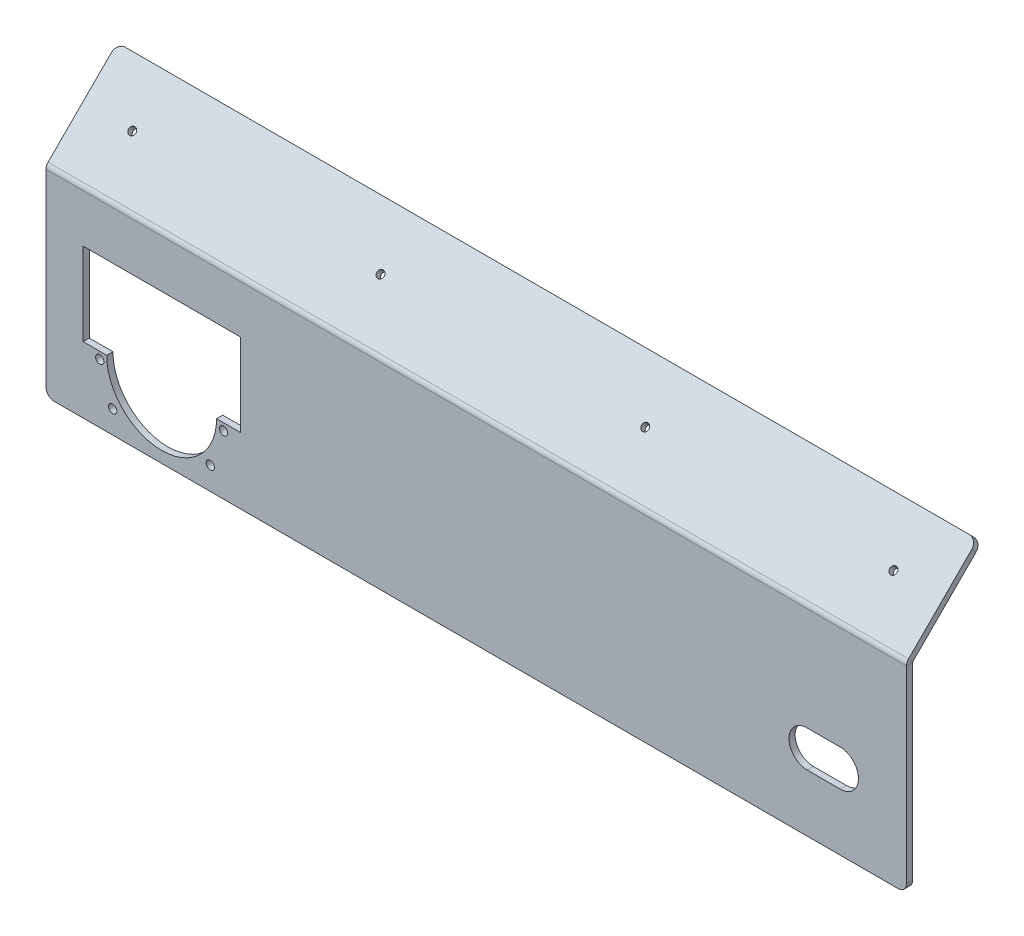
ISO-10303-21;
HEADER;
FILE_DESCRIPTION(('STEP AP214'),'2;1');
FILE_NAME('part.step','',(''),(''),'','','');
FILE_SCHEMA(('AUTOMOTIVE_DESIGN { 1 0 10303 214 1 1 1 1 }'));
ENDSEC;
DATA;
#1=APPLICATION_CONTEXT('core data for automotive mechanical design processes');
#2=APPLICATION_PROTOCOL_DEFINITION('international standard','automotive_design',2000,#1);
#3=PRODUCT_CONTEXT('',#1,'mechanical');
#4=PRODUCT('Part','Part','',(#3));
#5=PRODUCT_RELATED_PRODUCT_CATEGORY('part','',(#4));
#6=PRODUCT_DEFINITION_FORMATION('','',#4);
#7=PRODUCT_DEFINITION_CONTEXT('part definition',#1,'design');
#8=PRODUCT_DEFINITION('design','',#6,#7);
#9=PRODUCT_DEFINITION_SHAPE('','',#8);
#10=(LENGTH_UNIT() NAMED_UNIT(*) SI_UNIT(.MILLI.,.METRE.));
#11=(NAMED_UNIT(*) PLANE_ANGLE_UNIT() SI_UNIT($,.RADIAN.));
#12=(NAMED_UNIT(*) SI_UNIT($,.STERADIAN.) SOLID_ANGLE_UNIT());
#13=UNCERTAINTY_MEASURE_WITH_UNIT(LENGTH_MEASURE(1.E-05),#10,'distance_accuracy_value','');
#14=(GEOMETRIC_REPRESENTATION_CONTEXT(3) GLOBAL_UNCERTAINTY_ASSIGNED_CONTEXT((#13)) GLOBAL_UNIT_ASSIGNED_CONTEXT((#10,
#11,#12)) REPRESENTATION_CONTEXT('',''));
#15=CARTESIAN_POINT('',(0.,0.,0.));
#16=DIRECTION('',(0.,0.,1.));
#17=DIRECTION('',(1.,0.,0.));
#18=AXIS2_PLACEMENT_3D('',#15,#16,#17);
#19=CARTESIAN_POINT('',(0.,-23.8877504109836,-57.9940167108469));
#20=DIRECTION('',(0.,0.707106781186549,0.707106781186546));
#21=DIRECTION('',(1.,0.,0.));
#22=AXIS2_PLACEMENT_3D('',#19,#20,#21);
#23=PLANE('',#22);
#24=CARTESIAN_POINT('',(38.1,-50.3956361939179,-31.4861309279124));
#25=DIRECTION('',(0.,0.707106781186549,0.707106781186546));
#26=DIRECTION('',(0.,-0.707106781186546,0.707106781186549));
#27=AXIS2_PLACEMENT_3D('',#24,#25,#26);
#28=CIRCLE('',#27,2.794);
#29=CARTESIAN_POINT('',(38.1,-52.3712925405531,-29.5104745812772));
#30=VERTEX_POINT('',#29);
#31=EDGE_CURVE('E303',#30,#30,#28,.T.);
#32=ORIENTED_EDGE('',*,*,#31,.T.);
#33=EDGE_LOOP('',(#32));
#34=FACE_BOUND('',#33,.T.);
#35=CARTESIAN_POINT('',(228.6,-50.3956361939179,-31.4861309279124));
#36=DIRECTION('',(0.,0.707106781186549,0.707106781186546));
#37=DIRECTION('',(0.,-0.707106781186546,0.707106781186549));
#38=AXIS2_PLACEMENT_3D('',#35,#36,#37);
#39=CIRCLE('',#38,2.79399999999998);
#40=CARTESIAN_POINT('',(228.6,-52.3712925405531,-29.5104745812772));
#41=VERTEX_POINT('',#40);
#42=EDGE_CURVE('E300',#41,#41,#39,.T.);
#43=ORIENTED_EDGE('',*,*,#42,.T.);
#44=EDGE_LOOP('',(#43));
#45=FACE_BOUND('',#44,.T.);
#46=CARTESIAN_POINT('',(431.8,-50.3956361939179,-31.4861309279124));
#47=DIRECTION('',(0.,0.707106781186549,0.707106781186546));
#48=DIRECTION('',(0.,-0.707106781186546,0.707106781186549));
#49=AXIS2_PLACEMENT_3D('',#46,#47,#48);
#50=CIRCLE('',#49,2.79400000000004);
#51=CARTESIAN_POINT('',(431.8,-52.3712925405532,-29.5104745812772));
#52=VERTEX_POINT('',#51);
#53=EDGE_CURVE('E297',#52,#52,#50,.T.);
#54=ORIENTED_EDGE('',*,*,#53,.T.);
#55=EDGE_LOOP('',(#54));
#56=FACE_BOUND('',#55,.T.);
#57=CARTESIAN_POINT('',(622.3,-50.395636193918,-31.4861309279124));
#58=DIRECTION('',(0.,0.707106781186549,0.707106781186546));
#59=DIRECTION('',(0.,-0.707106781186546,0.707106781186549));
#60=AXIS2_PLACEMENT_3D('',#57,#58,#59);
#61=CIRCLE('',#60,2.79399999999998);
#62=CARTESIAN_POINT('',(622.3,-52.3712925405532,-29.5104745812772));
#63=VERTEX_POINT('',#62);
#64=EDGE_CURVE('E286',#63,#63,#61,.T.);
#65=ORIENTED_EDGE('',*,*,#64,.T.);
#66=EDGE_LOOP('',(#65));
#67=FACE_BOUND('',#66,.T.);
#68=DIRECTION('',(-1.,0.,0.));
#69=VECTOR('',#68,1.);
#70=CARTESIAN_POINT('',(0.,-23.8877504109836,-57.9940167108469));
#71=LINE('',#70,#69);
#72=CARTESIAN_POINT('',(654.05,-23.8877504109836,-57.9940167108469));
#73=VERTEX_POINT('',#72);
#74=CARTESIAN_POINT('',(6.35,-23.8877504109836,-57.9940167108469));
#75=VERTEX_POINT('',#74);
#76=EDGE_CURVE('E415',#73,#75,#71,.T.);
#77=ORIENTED_EDGE('',*,*,#76,.F.);
#78=CARTESIAN_POINT('',(654.05,-28.3778784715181,-53.5038886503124));
#79=DIRECTION('',(0.,0.707106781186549,0.707106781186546));
#80=DIRECTION('',(0.,-0.707106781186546,0.707106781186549));
#81=AXIS2_PLACEMENT_3D('',#78,#79,#80);
#82=CIRCLE('',#81,6.35);
#83=CARTESIAN_POINT('',(660.4,-28.3778784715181,-53.5038886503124));
#84=VERTEX_POINT('',#83);
#85=EDGE_CURVE('E469',#73,#84,#82,.F.);
#86=ORIENTED_EDGE('',*,*,#85,.T.);
#87=DIRECTION('',(0.,0.707106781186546,-0.707106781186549));
#88=VECTOR('',#87,1.);
#89=CARTESIAN_POINT('',(660.4,-23.8877504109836,-57.9940167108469));
#90=LINE('',#89,#88);
#91=CARTESIAN_POINT('',(660.4,-76.9035219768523,-4.97824514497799));
#92=VERTEX_POINT('',#91);
#93=EDGE_CURVE('E418',#92,#84,#90,.T.);
#94=ORIENTED_EDGE('',*,*,#93,.F.);
#95=DIRECTION('',(-1.,0.,0.));
#96=VECTOR('',#95,1.);
#97=CARTESIAN_POINT('',(0.,-76.9035219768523,-4.97824514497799));
#98=LINE('',#97,#96);
#99=CARTESIAN_POINT('',(0.,-76.9035219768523,-4.97824514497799));
#100=VERTEX_POINT('',#99);
#101=EDGE_CURVE('E417',#92,#100,#98,.T.);
#102=ORIENTED_EDGE('',*,*,#101,.T.);
#103=DIRECTION('',(0.,-0.707106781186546,0.707106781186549));
#104=VECTOR('',#103,1.);
#105=CARTESIAN_POINT('',(0.,-23.8877504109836,-57.9940167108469));
#106=LINE('',#105,#104);
#107=CARTESIAN_POINT('',(0.,-28.3778784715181,-53.5038886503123));
#108=VERTEX_POINT('',#107);
#109=EDGE_CURVE('E422',#108,#100,#106,.T.);
#110=ORIENTED_EDGE('',*,*,#109,.F.);
#111=CARTESIAN_POINT('',(6.35,-28.3778784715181,-53.5038886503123));
#112=DIRECTION('',(0.,0.707106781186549,0.707106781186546));
#113=DIRECTION('',(0.,-0.707106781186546,0.707106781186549));
#114=AXIS2_PLACEMENT_3D('',#111,#112,#113);
#115=CIRCLE('',#114,6.35);
#116=EDGE_CURVE('E109',#108,#75,#115,.F.);
#117=ORIENTED_EDGE('',*,*,#116,.T.);
#118=EDGE_LOOP('',(#77,#86,#94,#102,#110,#117));
#119=FACE_BOUND('',#118,.T.);
#120=ADVANCED_FACE('F89',(#34,#45,#56,#67,#119),#23,.F.);
#121=CARTESIAN_POINT('',(0.,-20.5201543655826,-54.626420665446));
#122=DIRECTION('',(0.,0.707106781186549,0.707106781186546));
#123=DIRECTION('',(1.,0.,0.));
#124=AXIS2_PLACEMENT_3D('',#121,#122,#123);
#125=PLANE('',#124);
#126=CARTESIAN_POINT('',(38.1,-47.028040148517,-28.1185348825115));
#127=DIRECTION('',(0.,0.707106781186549,0.707106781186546));
#128=DIRECTION('',(0.,-0.707106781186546,0.707106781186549));
#129=AXIS2_PLACEMENT_3D('',#126,#127,#128);
#130=CIRCLE('',#129,2.794);
#131=CARTESIAN_POINT('',(38.1,-49.0036964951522,-26.1428785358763));
#132=VERTEX_POINT('',#131);
#133=EDGE_CURVE('E283',#132,#132,#130,.T.);
#134=ORIENTED_EDGE('',*,*,#133,.F.);
#135=EDGE_LOOP('',(#134));
#136=FACE_BOUND('',#135,.T.);
#137=CARTESIAN_POINT('',(228.6,-47.028040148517,-28.1185348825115));
#138=DIRECTION('',(0.,0.707106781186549,0.707106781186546));
#139=DIRECTION('',(0.,-0.707106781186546,0.707106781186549));
#140=AXIS2_PLACEMENT_3D('',#137,#138,#139);
#141=CIRCLE('',#140,2.79399999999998);
#142=CARTESIAN_POINT('',(228.6,-49.0036964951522,-26.1428785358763));
#143=VERTEX_POINT('',#142);
#144=EDGE_CURVE('E287',#143,#143,#141,.T.);
#145=ORIENTED_EDGE('',*,*,#144,.F.);
#146=EDGE_LOOP('',(#145));
#147=FACE_BOUND('',#146,.T.);
#148=CARTESIAN_POINT('',(431.8,-47.028040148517,-28.1185348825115));
#149=DIRECTION('',(0.,0.707106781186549,0.707106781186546));
#150=DIRECTION('',(0.,-0.707106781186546,0.707106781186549));
#151=AXIS2_PLACEMENT_3D('',#148,#149,#150);
#152=CIRCLE('',#151,2.79400000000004);
#153=CARTESIAN_POINT('',(431.8,-49.0036964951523,-26.1428785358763));
#154=VERTEX_POINT('',#153);
#155=EDGE_CURVE('E290',#154,#154,#152,.T.);
#156=ORIENTED_EDGE('',*,*,#155,.F.);
#157=EDGE_LOOP('',(#156));
#158=FACE_BOUND('',#157,.T.);
#159=CARTESIAN_POINT('',(622.3,-47.028040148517,-28.1185348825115));
#160=DIRECTION('',(0.,0.707106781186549,0.707106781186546));
#161=DIRECTION('',(0.,-0.707106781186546,0.707106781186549));
#162=AXIS2_PLACEMENT_3D('',#159,#160,#161);
#163=CIRCLE('',#162,2.79399999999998);
#164=CARTESIAN_POINT('',(622.3,-49.0036964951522,-26.1428785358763));
#165=VERTEX_POINT('',#164);
#166=EDGE_CURVE('E282',#165,#165,#163,.T.);
#167=ORIENTED_EDGE('',*,*,#166,.F.);
#168=EDGE_LOOP('',(#167));
#169=FACE_BOUND('',#168,.T.);
#170=DIRECTION('',(0.,0.707106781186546,-0.707106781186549));
#171=VECTOR('',#170,1.);
#172=CARTESIAN_POINT('',(660.4,-20.5201543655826,-54.626420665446));
#173=LINE('',#172,#171);
#174=CARTESIAN_POINT('',(660.4,-73.5359259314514,-1.61064909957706));
#175=VERTEX_POINT('',#174);
#176=CARTESIAN_POINT('',(660.4,-25.0102824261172,-50.1362926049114));
#177=VERTEX_POINT('',#176);
#178=EDGE_CURVE('E423',#175,#177,#173,.T.);
#179=ORIENTED_EDGE('',*,*,#178,.T.);
#180=CARTESIAN_POINT('',(654.05,-25.0102824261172,-50.1362926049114));
#181=DIRECTION('',(0.,0.707106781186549,0.707106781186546));
#182=DIRECTION('',(0.,-0.707106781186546,0.707106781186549));
#183=AXIS2_PLACEMENT_3D('',#180,#181,#182);
#184=CIRCLE('',#183,6.35);
#185=CARTESIAN_POINT('',(654.05,-20.5201543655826,-54.626420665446));
#186=VERTEX_POINT('',#185);
#187=EDGE_CURVE('E461',#177,#186,#184,.T.);
#188=ORIENTED_EDGE('',*,*,#187,.T.);
#189=DIRECTION('',(-1.,0.,0.));
#190=VECTOR('',#189,1.);
#191=CARTESIAN_POINT('',(0.,-20.5201543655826,-54.626420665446));
#192=LINE('',#191,#190);
#193=CARTESIAN_POINT('',(6.35,-20.5201543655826,-54.626420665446));
#194=VERTEX_POINT('',#193);
#195=EDGE_CURVE('E419',#186,#194,#192,.T.);
#196=ORIENTED_EDGE('',*,*,#195,.T.);
#197=CARTESIAN_POINT('',(6.35,-25.0102824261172,-50.1362926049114));
#198=DIRECTION('',(0.,0.707106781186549,0.707106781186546));
#199=DIRECTION('',(0.,-0.707106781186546,0.707106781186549));
#200=AXIS2_PLACEMENT_3D('',#197,#198,#199);
#201=CIRCLE('',#200,6.35);
#202=CARTESIAN_POINT('',(0.,-25.0102824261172,-50.1362926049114));
#203=VERTEX_POINT('',#202);
#204=EDGE_CURVE('E459',#194,#203,#201,.T.);
#205=ORIENTED_EDGE('',*,*,#204,.T.);
#206=DIRECTION('',(0.,-0.707106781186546,0.707106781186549));
#207=VECTOR('',#206,1.);
#208=CARTESIAN_POINT('',(0.,-20.5201543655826,-54.626420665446));
#209=LINE('',#208,#207);
#210=CARTESIAN_POINT('',(0.,-73.5359259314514,-1.61064909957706));
#211=VERTEX_POINT('',#210);
#212=EDGE_CURVE('E322',#203,#211,#209,.T.);
#213=ORIENTED_EDGE('',*,*,#212,.T.);
#214=DIRECTION('',(-1.,0.,0.));
#215=VECTOR('',#214,1.);
#216=CARTESIAN_POINT('',(0.,-73.5359259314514,-1.61064909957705));
#217=LINE('',#216,#215);
#218=EDGE_CURVE('E429',#175,#211,#217,.T.);
#219=ORIENTED_EDGE('',*,*,#218,.F.);
#220=EDGE_LOOP('',(#179,#188,#196,#205,#213,#219));
#221=FACE_BOUND('',#220,.T.);
#222=ADVANCED_FACE('F515',(#136,#147,#158,#169,#221),#125,.T.);
#223=CARTESIAN_POINT('',(0.,-23.8877504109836,-57.9940167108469));
#224=DIRECTION('',(-1.,0.,0.));
#225=DIRECTION('',(0.,-0.707106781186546,0.707106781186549));
#226=AXIS2_PLACEMENT_3D('',#223,#224,#225);
#227=PLANE('',#226);
#228=ORIENTED_EDGE('',*,*,#212,.F.);
#229=DIRECTION('',(0.,0.707106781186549,0.707106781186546));
#230=VECTOR('',#229,1.);
#231=CARTESIAN_POINT('',(0.,-28.3778784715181,-53.5038886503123));
#232=LINE('',#231,#230);
#233=EDGE_CURVE('E12',#203,#108,#232,.F.);
#234=ORIENTED_EDGE('',*,*,#233,.T.);
#235=ORIENTED_EDGE('',*,*,#109,.T.);
#236=DIRECTION('',(0.,-0.707106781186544,-0.707106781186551));
#237=VECTOR('',#236,1.);
#238=CARTESIAN_POINT('',(0.,-76.9035219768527,-4.97824514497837));
#239=LINE('',#238,#237);
#240=EDGE_CURVE('E432',#211,#100,#239,.T.);
#241=ORIENTED_EDGE('',*,*,#240,.F.);
#242=EDGE_LOOP('',(#228,#234,#235,#241));
#243=FACE_BOUND('',#242,.T.);
#244=ADVANCED_FACE('F507',(#243),#227,.T.);
#245=CARTESIAN_POINT('',(0.,-23.8877504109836,-57.9940167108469));
#246=DIRECTION('',(0.,0.707106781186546,-0.707106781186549));
#247=DIRECTION('',(0.,0.707106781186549,0.707106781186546));
#248=AXIS2_PLACEMENT_3D('',#245,#246,#247);
#249=PLANE('',#248);
#250=ORIENTED_EDGE('',*,*,#195,.F.);
#251=DIRECTION('',(0.,0.707106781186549,0.707106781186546));
#252=VECTOR('',#251,1.);
#253=CARTESIAN_POINT('',(654.05,-23.8877504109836,-57.9940167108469));
#254=LINE('',#253,#252);
#255=EDGE_CURVE('E466',#186,#73,#254,.F.);
#256=ORIENTED_EDGE('',*,*,#255,.T.);
#257=ORIENTED_EDGE('',*,*,#76,.T.);
#258=DIRECTION('',(0.,0.707106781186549,0.707106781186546));
#259=VECTOR('',#258,1.);
#260=CARTESIAN_POINT('',(6.35,-23.8877504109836,-57.9940167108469));
#261=LINE('',#260,#259);
#262=EDGE_CURVE('E463',#75,#194,#261,.T.);
#263=ORIENTED_EDGE('',*,*,#262,.T.);
#264=EDGE_LOOP('',(#250,#256,#257,#263));
#265=FACE_BOUND('',#264,.T.);
#266=ADVANCED_FACE('F520',(#265),#249,.T.);
#267=CARTESIAN_POINT('',(660.4,-23.8877504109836,-57.9940167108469));
#268=DIRECTION('',(1.,0.,0.));
#269=DIRECTION('',(0.,-0.707106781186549,-0.707106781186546));
#270=AXIS2_PLACEMENT_3D('',#267,#268,#269);
#271=PLANE('',#270);
#272=ORIENTED_EDGE('',*,*,#93,.T.);
#273=DIRECTION('',(0.,0.707106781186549,0.707106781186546));
#274=VECTOR('',#273,1.);
#275=CARTESIAN_POINT('',(660.4,-28.3778784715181,-53.5038886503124));
#276=LINE('',#275,#274);
#277=EDGE_CURVE('E456',#84,#177,#276,.T.);
#278=ORIENTED_EDGE('',*,*,#277,.T.);
#279=ORIENTED_EDGE('',*,*,#178,.F.);
#280=DIRECTION('',(0.,0.707106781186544,0.707106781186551));
#281=VECTOR('',#280,1.);
#282=CARTESIAN_POINT('',(660.4,-76.9035219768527,-4.97824514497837));
#283=LINE('',#282,#281);
#284=EDGE_CURVE('E426',#92,#175,#283,.T.);
#285=ORIENTED_EDGE('',*,*,#284,.F.);
#286=EDGE_LOOP('',(#272,#278,#279,#285));
#287=FACE_BOUND('',#286,.T.);
#288=ADVANCED_FACE('F512',(#287),#271,.T.);
#289=CARTESIAN_POINT('',(28.448,-177.8,-4.7625));
#290=DIRECTION('',(0.,-1.,0.));
#291=DIRECTION('',(0.,0.,-1.));
#292=AXIS2_PLACEMENT_3D('',#289,#290,#291);
#293=PLANE('',#292);
#294=DIRECTION('',(0.,0.,1.));
#295=VECTOR('',#294,1.);
#296=CARTESIAN_POINT('',(46.624156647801,-177.8,-4.7625));
#297=LINE('',#296,#295);
#298=CARTESIAN_POINT('',(46.624156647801,-177.8,-4.7625));
#299=VERTEX_POINT('',#298);
#300=CARTESIAN_POINT('',(46.624156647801,-177.8,0.));
#301=VERTEX_POINT('',#300);
#302=EDGE_CURVE('E385',#299,#301,#297,.T.);
#303=ORIENTED_EDGE('',*,*,#302,.F.);
#304=DIRECTION('',(1.,0.,0.));
#305=VECTOR('',#304,1.);
#306=CARTESIAN_POINT('',(28.448,-177.8,-4.7625));
#307=LINE('',#306,#305);
#308=CARTESIAN_POINT('',(28.448,-177.8,-4.7625));
#309=VERTEX_POINT('',#308);
#310=EDGE_CURVE('E345',#309,#299,#307,.T.);
#311=ORIENTED_EDGE('',*,*,#310,.F.);
#312=DIRECTION('',(0.,0.,1.));
#313=VECTOR('',#312,1.);
#314=CARTESIAN_POINT('',(28.448,-177.8,-4.7625));
#315=LINE('',#314,#313);
#316=CARTESIAN_POINT('',(28.448,-177.8,0.));
#317=VERTEX_POINT('',#316);
#318=EDGE_CURVE('E394',#309,#317,#315,.T.);
#319=ORIENTED_EDGE('',*,*,#318,.T.);
#320=DIRECTION('',(1.,0.,0.));
#321=VECTOR('',#320,1.);
#322=CARTESIAN_POINT('',(28.448,-177.8,0.));
#323=LINE('',#322,#321);
#324=EDGE_CURVE('E390',#317,#301,#323,.T.);
#325=ORIENTED_EDGE('',*,*,#324,.T.);
#326=EDGE_LOOP('',(#303,#311,#319,#325));
#327=FACE_BOUND('',#326,.T.);
#328=ADVANCED_FACE('F547',(#327),#293,.F.);
#329=CARTESIAN_POINT('',(28.448,-177.8,-4.7625));
#330=DIRECTION('',(-1.,0.,0.));
#331=DIRECTION('',(0.,0.,1.));
#332=AXIS2_PLACEMENT_3D('',#329,#330,#331);
#333=PLANE('',#332);
#334=DIRECTION('',(0.,-1.,0.));
#335=VECTOR('',#334,1.);
#336=CARTESIAN_POINT('',(28.448,-177.8,0.));
#337=LINE('',#336,#335);
#338=CARTESIAN_POINT('',(28.448,-114.3,0.));
#339=VERTEX_POINT('',#338);
#340=EDGE_CURVE('E393',#339,#317,#337,.T.);
#341=ORIENTED_EDGE('',*,*,#340,.T.);
#342=ORIENTED_EDGE('',*,*,#318,.F.);
#343=DIRECTION('',(0.,-1.,0.));
#344=VECTOR('',#343,1.);
#345=CARTESIAN_POINT('',(28.448,-177.8,-4.7625));
#346=LINE('',#345,#344);
#347=CARTESIAN_POINT('',(28.448,-114.3,-4.7625));
#348=VERTEX_POINT('',#347);
#349=EDGE_CURVE('E348',#348,#309,#346,.T.);
#350=ORIENTED_EDGE('',*,*,#349,.F.);
#351=DIRECTION('',(0.,0.,1.));
#352=VECTOR('',#351,1.);
#353=CARTESIAN_POINT('',(28.448,-114.3,-4.7625));
#354=LINE('',#353,#352);
#355=EDGE_CURVE('E409',#348,#339,#354,.T.);
#356=ORIENTED_EDGE('',*,*,#355,.T.);
#357=EDGE_LOOP('',(#341,#342,#350,#356));
#358=FACE_BOUND('',#357,.T.);
#359=ADVANCED_FACE('F566',(#358),#333,.F.);
#360=CARTESIAN_POINT('',(28.448,-114.3,-4.7625));
#361=DIRECTION('',(0.,1.,0.));
#362=DIRECTION('',(0.,0.,1.));
#363=AXIS2_PLACEMENT_3D('',#360,#361,#362);
#364=PLANE('',#363);
#365=DIRECTION('',(-1.,0.,0.));
#366=VECTOR('',#365,1.);
#367=CARTESIAN_POINT('',(28.448,-114.3,0.));
#368=LINE('',#367,#366);
#369=CARTESIAN_POINT('',(149.098,-114.3,0.));
#370=VERTEX_POINT('',#369);
#371=EDGE_CURVE('E406',#370,#339,#368,.T.);
#372=ORIENTED_EDGE('',*,*,#371,.T.);
#373=ORIENTED_EDGE('',*,*,#355,.F.);
#374=DIRECTION('',(-1.,0.,0.));
#375=VECTOR('',#374,1.);
#376=CARTESIAN_POINT('',(28.448,-114.3,-4.7625));
#377=LINE('',#376,#375);
#378=CARTESIAN_POINT('',(149.098,-114.3,-4.7625));
#379=VERTEX_POINT('',#378);
#380=EDGE_CURVE('E352',#379,#348,#377,.T.);
#381=ORIENTED_EDGE('',*,*,#380,.F.);
#382=DIRECTION('',(0.,0.,1.));
#383=VECTOR('',#382,1.);
#384=CARTESIAN_POINT('',(149.098,-114.3,-4.7625));
#385=LINE('',#384,#383);
#386=EDGE_CURVE('E404',#379,#370,#385,.T.);
#387=ORIENTED_EDGE('',*,*,#386,.T.);
#388=EDGE_LOOP('',(#372,#373,#381,#387));
#389=FACE_BOUND('',#388,.T.);
#390=ADVANCED_FACE('F575',(#389),#364,.F.);
#391=CARTESIAN_POINT('',(149.098,-177.8,-4.7625));
#392=DIRECTION('',(1.,0.,0.));
#393=DIRECTION('',(0.,1.,0.));
#394=AXIS2_PLACEMENT_3D('',#391,#392,#393);
#395=PLANE('',#394);
#396=DIRECTION('',(0.,1.,0.));
#397=VECTOR('',#396,1.);
#398=CARTESIAN_POINT('',(149.098,-177.8,0.));
#399=LINE('',#398,#397);
#400=CARTESIAN_POINT('',(149.098,-177.8,0.));
#401=VERTEX_POINT('',#400);
#402=EDGE_CURVE('E401',#401,#370,#399,.T.);
#403=ORIENTED_EDGE('',*,*,#402,.T.);
#404=ORIENTED_EDGE('',*,*,#386,.F.);
#405=DIRECTION('',(0.,1.,0.));
#406=VECTOR('',#405,1.);
#407=CARTESIAN_POINT('',(149.098,-177.8,-4.7625));
#408=LINE('',#407,#406);
#409=CARTESIAN_POINT('',(149.098,-177.8,-4.7625));
#410=VERTEX_POINT('',#409);
#411=EDGE_CURVE('E355',#410,#379,#408,.T.);
#412=ORIENTED_EDGE('',*,*,#411,.F.);
#413=DIRECTION('',(0.,0.,1.));
#414=VECTOR('',#413,1.);
#415=CARTESIAN_POINT('',(149.098,-177.8,-4.7625));
#416=LINE('',#415,#414);
#417=EDGE_CURVE('E398',#410,#401,#416,.T.);
#418=ORIENTED_EDGE('',*,*,#417,.T.);
#419=EDGE_LOOP('',(#403,#404,#412,#418));
#420=FACE_BOUND('',#419,.T.);
#421=ADVANCED_FACE('F583',(#420),#395,.F.);
#422=DIRECTION('',(0.,0.,1.));
#423=VECTOR('',#422,1.);
#424=CARTESIAN_POINT('',(130.921843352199,-177.8,-4.7625));
#425=LINE('',#424,#423);
#426=CARTESIAN_POINT('',(130.921843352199,-177.8,-4.7625));
#427=VERTEX_POINT('',#426);
#428=CARTESIAN_POINT('',(130.921843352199,-177.8,0.));
#429=VERTEX_POINT('',#428);
#430=EDGE_CURVE('E395',#427,#429,#425,.T.);
#431=ORIENTED_EDGE('',*,*,#430,.T.);
#432=EDGE_CURVE('E389',#429,#401,#323,.T.);
#433=ORIENTED_EDGE('',*,*,#432,.T.);
#434=ORIENTED_EDGE('',*,*,#417,.F.);
#435=EDGE_CURVE('E349',#427,#410,#307,.T.);
#436=ORIENTED_EDGE('',*,*,#435,.F.);
#437=EDGE_LOOP('',(#431,#433,#434,#436));
#438=FACE_BOUND('',#437,.T.);
#439=ADVANCED_FACE('F569',(#438),#293,.F.);
#440=CARTESIAN_POINT('',(88.773,-177.8,-4.7625));
#441=DIRECTION('',(0.,0.,1.));
#442=DIRECTION('',(1.,0.,0.));
#443=AXIS2_PLACEMENT_3D('',#440,#441,#442);
#444=CYLINDRICAL_SURFACE('',#443,42.148843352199);
#445=ORIENTED_EDGE('',*,*,#430,.F.);
#446=CARTESIAN_POINT('',(88.773,-177.8,-4.7625));
#447=DIRECTION('',(0.,0.,-1.));
#448=DIRECTION('',(-1.,0.,0.));
#449=AXIS2_PLACEMENT_3D('',#446,#447,#448);
#450=CIRCLE('',#449,42.148843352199);
#451=EDGE_CURVE('E387',#427,#299,#450,.T.);
#452=ORIENTED_EDGE('',*,*,#451,.T.);
#453=ORIENTED_EDGE('',*,*,#302,.T.);
#454=CARTESIAN_POINT('',(88.773,-177.8,0.));
#455=DIRECTION('',(0.,0.,-1.));
#456=DIRECTION('',(-1.,0.,0.));
#457=AXIS2_PLACEMENT_3D('',#454,#455,#456);
#458=CIRCLE('',#457,42.148843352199);
#459=EDGE_CURVE('E337',#429,#301,#458,.T.);
#460=ORIENTED_EDGE('',*,*,#459,.F.);
#461=EDGE_LOOP('',(#445,#452,#453,#460));
#462=FACE_BOUND('',#461,.T.);
#463=ADVANCED_FACE('F598',(#462),#444,.F.);
#464=CARTESIAN_POINT('',(41.275,-183.134,-4.7625));
#465=DIRECTION('',(0.,0.,1.));
#466=DIRECTION('',(1.,0.,0.));
#467=AXIS2_PLACEMENT_3D('',#464,#465,#466);
#468=CYLINDRICAL_SURFACE('',#467,3.175);
#469=CARTESIAN_POINT('',(41.275,-183.134,-4.7625));
#470=DIRECTION('',(0.,0.,1.));
#471=DIRECTION('',(1.,0.,0.));
#472=AXIS2_PLACEMENT_3D('',#469,#470,#471);
#473=CIRCLE('',#472,3.175);
#474=CARTESIAN_POINT('',(44.45,-183.134,-4.7625));
#475=VERTEX_POINT('',#474);
#476=EDGE_CURVE('E358',#475,#475,#473,.T.);
#477=CARTESIAN_POINT('',(41.275,-183.134,0.));
#478=DIRECTION('',(0.,0.,1.));
#479=DIRECTION('',(1.,0.,0.));
#480=AXIS2_PLACEMENT_3D('',#477,#478,#479);
#481=CIRCLE('',#480,3.175);
#482=CARTESIAN_POINT('',(44.45,-183.134,0.));
#483=VERTEX_POINT('',#482);
#484=EDGE_CURVE('E382',#483,#483,#481,.T.);
#485=CARTESIAN_POINT('',(44.45,-183.134,-4.7625));
#486=CARTESIAN_POINT('',(44.45,-183.134,-4.712890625));
#487=CARTESIAN_POINT('',(44.45,-183.134,-4.66328125));
#488=CARTESIAN_POINT('',(44.45,-183.134,-4.5640625));
#489=CARTESIAN_POINT('',(44.45,-183.134,-4.514453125));
#490=CARTESIAN_POINT('',(44.45,-183.134,-4.415234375));
#491=CARTESIAN_POINT('',(44.45,-183.134,-4.365625));
#492=CARTESIAN_POINT('',(44.45,-183.134,-4.26640625));
#493=CARTESIAN_POINT('',(44.45,-183.134,-4.216796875));
#494=CARTESIAN_POINT('',(44.45,-183.134,-4.117578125));
#495=CARTESIAN_POINT('',(44.45,-183.134,-4.06796875));
#496=CARTESIAN_POINT('',(44.45,-183.134,-3.96875));
#497=CARTESIAN_POINT('',(44.45,-183.134,-3.919140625));
#498=CARTESIAN_POINT('',(44.45,-183.134,-3.819921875));
#499=CARTESIAN_POINT('',(44.45,-183.134,-3.7703125));
#500=CARTESIAN_POINT('',(44.45,-183.134,-3.67109375));
#501=CARTESIAN_POINT('',(44.45,-183.134,-3.621484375));
#502=CARTESIAN_POINT('',(44.45,-183.134,-3.522265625));
#503=CARTESIAN_POINT('',(44.45,-183.134,-3.47265625));
#504=CARTESIAN_POINT('',(44.45,-183.134,-3.3734375));
#505=CARTESIAN_POINT('',(44.45,-183.134,-3.323828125));
#506=CARTESIAN_POINT('',(44.45,-183.134,-3.224609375));
#507=CARTESIAN_POINT('',(44.45,-183.134,-3.175));
#508=CARTESIAN_POINT('',(44.45,-183.134,-3.07578125));
#509=CARTESIAN_POINT('',(44.45,-183.134,-3.026171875));
#510=CARTESIAN_POINT('',(44.45,-183.134,-2.926953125));
#511=CARTESIAN_POINT('',(44.45,-183.134,-2.87734375));
#512=CARTESIAN_POINT('',(44.45,-183.134,-2.778125));
#513=CARTESIAN_POINT('',(44.45,-183.134,-2.728515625));
#514=CARTESIAN_POINT('',(44.45,-183.134,-2.629296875));
#515=CARTESIAN_POINT('',(44.45,-183.134,-2.5796875));
#516=CARTESIAN_POINT('',(44.45,-183.134,-2.48046875));
#517=CARTESIAN_POINT('',(44.45,-183.134,-2.430859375));
#518=CARTESIAN_POINT('',(44.45,-183.134,-2.331640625));
#519=CARTESIAN_POINT('',(44.45,-183.134,-2.28203125));
#520=CARTESIAN_POINT('',(44.45,-183.134,-2.1828125));
#521=CARTESIAN_POINT('',(44.45,-183.134,-2.133203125));
#522=CARTESIAN_POINT('',(44.45,-183.134,-2.033984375));
#523=CARTESIAN_POINT('',(44.45,-183.134,-1.984375));
#524=CARTESIAN_POINT('',(44.45,-183.134,-1.88515625));
#525=CARTESIAN_POINT('',(44.45,-183.134,-1.835546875));
#526=CARTESIAN_POINT('',(44.45,-183.134,-1.736328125));
#527=CARTESIAN_POINT('',(44.45,-183.134,-1.68671875));
#528=CARTESIAN_POINT('',(44.45,-183.134,-1.5875));
#529=CARTESIAN_POINT('',(44.45,-183.134,-1.537890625));
#530=CARTESIAN_POINT('',(44.45,-183.134,-1.438671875));
#531=CARTESIAN_POINT('',(44.45,-183.134,-1.3890625));
#532=CARTESIAN_POINT('',(44.45,-183.134,-1.28984375));
#533=CARTESIAN_POINT('',(44.45,-183.134,-1.240234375));
#534=CARTESIAN_POINT('',(44.45,-183.134,-1.141015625));
#535=CARTESIAN_POINT('',(44.45,-183.134,-1.09140625));
#536=CARTESIAN_POINT('',(44.45,-183.134,-0.9921875));
#537=CARTESIAN_POINT('',(44.45,-183.134,-0.942578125));
#538=CARTESIAN_POINT('',(44.45,-183.134,-0.843359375));
#539=CARTESIAN_POINT('',(44.45,-183.134,-0.79375));
#540=CARTESIAN_POINT('',(44.45,-183.134,-0.69453125));
#541=CARTESIAN_POINT('',(44.45,-183.134,-0.644921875));
#542=CARTESIAN_POINT('',(44.45,-183.134,-0.545703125));
#543=CARTESIAN_POINT('',(44.45,-183.134,-0.49609375));
#544=CARTESIAN_POINT('',(44.45,-183.134,-0.396875));
#545=CARTESIAN_POINT('',(44.45,-183.134,-0.347265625));
#546=CARTESIAN_POINT('',(44.45,-183.134,-0.248046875));
#547=CARTESIAN_POINT('',(44.45,-183.134,-0.1984375));
#548=CARTESIAN_POINT('',(44.45,-183.134,-0.09921875));
#549=CARTESIAN_POINT('',(44.45,-183.134,-0.049609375));
#550=CARTESIAN_POINT('',(44.45,-183.134,0.));
#551=B_SPLINE_CURVE_WITH_KNOTS('',3,(#485,#486,#487,#488,#489,#490,#491,#492,#493,#494,#495,
#496,#497,#498,#499,#500,#501,#502,#503,#504,#505,#506,#507,#508,#509,#510,#511,#512,#513,#514,
#515,#516,#517,#518,#519,#520,#521,#522,#523,#524,#525,#526,#527,#528,#529,#530,#531,#532,#533,
#534,#535,#536,#537,#538,#539,#540,#541,#542,#543,#544,#545,#546,#547,#548,#549,#550),
.UNSPECIFIED.,.F.,.F.,(4,2,2,2,2,2,2,2,2,2,2,2,2,2,2,2,2,2,2,2,2,2,2,2,2,2,2,2,2,2,2,2,4),(0.,
0.148828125,0.29765625,0.446484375,0.5953125,0.744140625,0.892968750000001,1.041796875,1.190625,
1.339453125,1.48828125,1.637109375,1.7859375,1.934765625,2.08359375,2.232421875,2.38125,
2.530078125,2.67890625,2.827734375,2.9765625,3.125390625,3.27421875,3.423046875,3.571875,
3.720703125,3.86953125,4.018359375,4.1671875,4.316015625,4.46484375,4.613671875,4.7625),.UNSPECIFIED.);
#552=EDGE_CURVE('BSEAM605',#475,#483,#551,.T.);
#553=ORIENTED_EDGE('',*,*,#476,.F.);
#554=ORIENTED_EDGE('',*,*,#484,.T.);
#555=ORIENTED_EDGE('',*,*,#552,.T.);
#556=ORIENTED_EDGE('',*,*,#552,.F.);
#557=EDGE_LOOP('',(#553,#555,#554,#556));
#558=FACE_BOUND('',#557,.T.);
#559=ADVANCED_FACE('F605',(#558),#468,.F.);
#560=CARTESIAN_POINT('',(51.181,-211.074,-4.7625));
#561=DIRECTION('',(0.,0.,1.));
#562=DIRECTION('',(1.,0.,0.));
#563=AXIS2_PLACEMENT_3D('',#560,#561,#562);
#564=CYLINDRICAL_SURFACE('',#563,3.175);
#565=CARTESIAN_POINT('',(51.181,-211.074,-4.7625));
#566=DIRECTION('',(0.,0.,1.));
#567=DIRECTION('',(1.,0.,0.));
#568=AXIS2_PLACEMENT_3D('',#565,#566,#567);
#569=CIRCLE('',#568,3.175);
#570=CARTESIAN_POINT('',(54.356,-211.074,-4.7625));
#571=VERTEX_POINT('',#570);
#572=EDGE_CURVE('E361',#571,#571,#569,.T.);
#573=CARTESIAN_POINT('',(51.181,-211.074,0.));
#574=DIRECTION('',(0.,0.,1.));
#575=DIRECTION('',(1.,0.,0.));
#576=AXIS2_PLACEMENT_3D('',#573,#574,#575);
#577=CIRCLE('',#576,3.175);
#578=CARTESIAN_POINT('',(54.356,-211.074,0.));
#579=VERTEX_POINT('',#578);
#580=EDGE_CURVE('E379',#579,#579,#577,.T.);
#581=CARTESIAN_POINT('',(54.356,-211.074,-4.7625));
#582=CARTESIAN_POINT('',(54.356,-211.074,-4.712890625));
#583=CARTESIAN_POINT('',(54.356,-211.074,-4.66328125));
#584=CARTESIAN_POINT('',(54.356,-211.074,-4.5640625));
#585=CARTESIAN_POINT('',(54.356,-211.074,-4.514453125));
#586=CARTESIAN_POINT('',(54.356,-211.074,-4.415234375));
#587=CARTESIAN_POINT('',(54.356,-211.074,-4.365625));
#588=CARTESIAN_POINT('',(54.356,-211.074,-4.26640625));
#589=CARTESIAN_POINT('',(54.356,-211.074,-4.216796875));
#590=CARTESIAN_POINT('',(54.356,-211.074,-4.117578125));
#591=CARTESIAN_POINT('',(54.356,-211.074,-4.06796875));
#592=CARTESIAN_POINT('',(54.356,-211.074,-3.96875));
#593=CARTESIAN_POINT('',(54.356,-211.074,-3.919140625));
#594=CARTESIAN_POINT('',(54.356,-211.074,-3.819921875));
#595=CARTESIAN_POINT('',(54.356,-211.074,-3.7703125));
#596=CARTESIAN_POINT('',(54.356,-211.074,-3.67109375));
#597=CARTESIAN_POINT('',(54.356,-211.074,-3.621484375));
#598=CARTESIAN_POINT('',(54.356,-211.074,-3.522265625));
#599=CARTESIAN_POINT('',(54.356,-211.074,-3.47265625));
#600=CARTESIAN_POINT('',(54.356,-211.074,-3.3734375));
#601=CARTESIAN_POINT('',(54.356,-211.074,-3.323828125));
#602=CARTESIAN_POINT('',(54.356,-211.074,-3.224609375));
#603=CARTESIAN_POINT('',(54.356,-211.074,-3.175));
#604=CARTESIAN_POINT('',(54.356,-211.074,-3.07578125));
#605=CARTESIAN_POINT('',(54.356,-211.074,-3.026171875));
#606=CARTESIAN_POINT('',(54.356,-211.074,-2.926953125));
#607=CARTESIAN_POINT('',(54.356,-211.074,-2.87734375));
#608=CARTESIAN_POINT('',(54.356,-211.074,-2.778125));
#609=CARTESIAN_POINT('',(54.356,-211.074,-2.728515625));
#610=CARTESIAN_POINT('',(54.356,-211.074,-2.629296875));
#611=CARTESIAN_POINT('',(54.356,-211.074,-2.5796875));
#612=CARTESIAN_POINT('',(54.356,-211.074,-2.48046875));
#613=CARTESIAN_POINT('',(54.356,-211.074,-2.430859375));
#614=CARTESIAN_POINT('',(54.356,-211.074,-2.331640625));
#615=CARTESIAN_POINT('',(54.356,-211.074,-2.28203125));
#616=CARTESIAN_POINT('',(54.356,-211.074,-2.1828125));
#617=CARTESIAN_POINT('',(54.356,-211.074,-2.133203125));
#618=CARTESIAN_POINT('',(54.356,-211.074,-2.033984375));
#619=CARTESIAN_POINT('',(54.356,-211.074,-1.984375));
#620=CARTESIAN_POINT('',(54.356,-211.074,-1.88515625));
#621=CARTESIAN_POINT('',(54.356,-211.074,-1.835546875));
#622=CARTESIAN_POINT('',(54.356,-211.074,-1.736328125));
#623=CARTESIAN_POINT('',(54.356,-211.074,-1.68671875));
#624=CARTESIAN_POINT('',(54.356,-211.074,-1.5875));
#625=CARTESIAN_POINT('',(54.356,-211.074,-1.537890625));
#626=CARTESIAN_POINT('',(54.356,-211.074,-1.438671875));
#627=CARTESIAN_POINT('',(54.356,-211.074,-1.3890625));
#628=CARTESIAN_POINT('',(54.356,-211.074,-1.28984375));
#629=CARTESIAN_POINT('',(54.356,-211.074,-1.240234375));
#630=CARTESIAN_POINT('',(54.356,-211.074,-1.141015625));
#631=CARTESIAN_POINT('',(54.356,-211.074,-1.09140625));
#632=CARTESIAN_POINT('',(54.356,-211.074,-0.9921875));
#633=CARTESIAN_POINT('',(54.356,-211.074,-0.942578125));
#634=CARTESIAN_POINT('',(54.356,-211.074,-0.843359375));
#635=CARTESIAN_POINT('',(54.356,-211.074,-0.79375));
#636=CARTESIAN_POINT('',(54.356,-211.074,-0.69453125));
#637=CARTESIAN_POINT('',(54.356,-211.074,-0.644921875));
#638=CARTESIAN_POINT('',(54.356,-211.074,-0.545703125));
#639=CARTESIAN_POINT('',(54.356,-211.074,-0.49609375));
#640=CARTESIAN_POINT('',(54.356,-211.074,-0.396875));
#641=CARTESIAN_POINT('',(54.356,-211.074,-0.347265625));
#642=CARTESIAN_POINT('',(54.356,-211.074,-0.248046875));
#643=CARTESIAN_POINT('',(54.356,-211.074,-0.1984375));
#644=CARTESIAN_POINT('',(54.356,-211.074,-0.09921875));
#645=CARTESIAN_POINT('',(54.356,-211.074,-0.049609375));
#646=CARTESIAN_POINT('',(54.356,-211.074,0.));
#647=B_SPLINE_CURVE_WITH_KNOTS('',3,(#581,#582,#583,#584,#585,#586,#587,#588,#589,#590,#591,
#592,#593,#594,#595,#596,#597,#598,#599,#600,#601,#602,#603,#604,#605,#606,#607,#608,#609,#610,
#611,#612,#613,#614,#615,#616,#617,#618,#619,#620,#621,#622,#623,#624,#625,#626,#627,#628,#629,
#630,#631,#632,#633,#634,#635,#636,#637,#638,#639,#640,#641,#642,#643,#644,#645,#646),
.UNSPECIFIED.,.F.,.F.,(4,2,2,2,2,2,2,2,2,2,2,2,2,2,2,2,2,2,2,2,2,2,2,2,2,2,2,2,2,2,2,2,4),(0.,
0.148828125,0.29765625,0.446484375,0.5953125,0.744140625,0.892968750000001,1.041796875,1.190625,
1.339453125,1.48828125,1.637109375,1.7859375,1.934765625,2.08359375,2.232421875,2.38125,
2.530078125,2.67890625,2.827734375,2.9765625,3.125390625,3.27421875,3.423046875,3.571875,
3.720703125,3.86953125,4.018359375,4.1671875,4.316015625,4.46484375,4.613671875,4.7625),.UNSPECIFIED.);
#648=EDGE_CURVE('BSEAM613',#571,#579,#647,.T.);
#649=ORIENTED_EDGE('',*,*,#572,.F.);
#650=ORIENTED_EDGE('',*,*,#580,.T.);
#651=ORIENTED_EDGE('',*,*,#648,.T.);
#652=ORIENTED_EDGE('',*,*,#648,.F.);
#653=EDGE_LOOP('',(#649,#651,#650,#652));
#654=FACE_BOUND('',#653,.T.);
#655=ADVANCED_FACE('F613',(#654),#564,.F.);
#656=CARTESIAN_POINT('',(126.111,-211.074,-4.7625));
#657=DIRECTION('',(0.,0.,1.));
#658=DIRECTION('',(1.,0.,0.));
#659=AXIS2_PLACEMENT_3D('',#656,#657,#658);
#660=CYLINDRICAL_SURFACE('',#659,3.17499999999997);
#661=CARTESIAN_POINT('',(126.111,-211.074,-4.7625));
#662=DIRECTION('',(0.,0.,1.));
#663=DIRECTION('',(1.,0.,0.));
#664=AXIS2_PLACEMENT_3D('',#661,#662,#663);
#665=CIRCLE('',#664,3.17499999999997);
#666=CARTESIAN_POINT('',(129.286,-211.074,-4.7625));
#667=VERTEX_POINT('',#666);
#668=EDGE_CURVE('E364',#667,#667,#665,.T.);
#669=CARTESIAN_POINT('',(126.111,-211.074,0.));
#670=DIRECTION('',(0.,0.,1.));
#671=DIRECTION('',(1.,0.,0.));
#672=AXIS2_PLACEMENT_3D('',#669,#670,#671);
#673=CIRCLE('',#672,3.17499999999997);
#674=CARTESIAN_POINT('',(129.286,-211.074,0.));
#675=VERTEX_POINT('',#674);
#676=EDGE_CURVE('E376',#675,#675,#673,.T.);
#677=CARTESIAN_POINT('',(129.286,-211.074,-4.7625));
#678=CARTESIAN_POINT('',(129.286,-211.074,-4.712890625));
#679=CARTESIAN_POINT('',(129.286,-211.074,-4.66328125));
#680=CARTESIAN_POINT('',(129.286,-211.074,-4.5640625));
#681=CARTESIAN_POINT('',(129.286,-211.074,-4.514453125));
#682=CARTESIAN_POINT('',(129.286,-211.074,-4.415234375));
#683=CARTESIAN_POINT('',(129.286,-211.074,-4.365625));
#684=CARTESIAN_POINT('',(129.286,-211.074,-4.26640625));
#685=CARTESIAN_POINT('',(129.286,-211.074,-4.216796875));
#686=CARTESIAN_POINT('',(129.286,-211.074,-4.117578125));
#687=CARTESIAN_POINT('',(129.286,-211.074,-4.06796875));
#688=CARTESIAN_POINT('',(129.286,-211.074,-3.96875));
#689=CARTESIAN_POINT('',(129.286,-211.074,-3.919140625));
#690=CARTESIAN_POINT('',(129.286,-211.074,-3.819921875));
#691=CARTESIAN_POINT('',(129.286,-211.074,-3.7703125));
#692=CARTESIAN_POINT('',(129.286,-211.074,-3.67109375));
#693=CARTESIAN_POINT('',(129.286,-211.074,-3.621484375));
#694=CARTESIAN_POINT('',(129.286,-211.074,-3.522265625));
#695=CARTESIAN_POINT('',(129.286,-211.074,-3.47265625));
#696=CARTESIAN_POINT('',(129.286,-211.074,-3.3734375));
#697=CARTESIAN_POINT('',(129.286,-211.074,-3.323828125));
#698=CARTESIAN_POINT('',(129.286,-211.074,-3.224609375));
#699=CARTESIAN_POINT('',(129.286,-211.074,-3.175));
#700=CARTESIAN_POINT('',(129.286,-211.074,-3.07578125));
#701=CARTESIAN_POINT('',(129.286,-211.074,-3.026171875));
#702=CARTESIAN_POINT('',(129.286,-211.074,-2.926953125));
#703=CARTESIAN_POINT('',(129.286,-211.074,-2.87734375));
#704=CARTESIAN_POINT('',(129.286,-211.074,-2.778125));
#705=CARTESIAN_POINT('',(129.286,-211.074,-2.728515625));
#706=CARTESIAN_POINT('',(129.286,-211.074,-2.629296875));
#707=CARTESIAN_POINT('',(129.286,-211.074,-2.5796875));
#708=CARTESIAN_POINT('',(129.286,-211.074,-2.48046875));
#709=CARTESIAN_POINT('',(129.286,-211.074,-2.430859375));
#710=CARTESIAN_POINT('',(129.286,-211.074,-2.331640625));
#711=CARTESIAN_POINT('',(129.286,-211.074,-2.28203125));
#712=CARTESIAN_POINT('',(129.286,-211.074,-2.1828125));
#713=CARTESIAN_POINT('',(129.286,-211.074,-2.133203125));
#714=CARTESIAN_POINT('',(129.286,-211.074,-2.033984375));
#715=CARTESIAN_POINT('',(129.286,-211.074,-1.984375));
#716=CARTESIAN_POINT('',(129.286,-211.074,-1.88515625));
#717=CARTESIAN_POINT('',(129.286,-211.074,-1.835546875));
#718=CARTESIAN_POINT('',(129.286,-211.074,-1.736328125));
#719=CARTESIAN_POINT('',(129.286,-211.074,-1.68671875));
#720=CARTESIAN_POINT('',(129.286,-211.074,-1.5875));
#721=CARTESIAN_POINT('',(129.286,-211.074,-1.537890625));
#722=CARTESIAN_POINT('',(129.286,-211.074,-1.438671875));
#723=CARTESIAN_POINT('',(129.286,-211.074,-1.3890625));
#724=CARTESIAN_POINT('',(129.286,-211.074,-1.28984375));
#725=CARTESIAN_POINT('',(129.286,-211.074,-1.240234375));
#726=CARTESIAN_POINT('',(129.286,-211.074,-1.141015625));
#727=CARTESIAN_POINT('',(129.286,-211.074,-1.09140625));
#728=CARTESIAN_POINT('',(129.286,-211.074,-0.9921875));
#729=CARTESIAN_POINT('',(129.286,-211.074,-0.942578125));
#730=CARTESIAN_POINT('',(129.286,-211.074,-0.843359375));
#731=CARTESIAN_POINT('',(129.286,-211.074,-0.79375));
#732=CARTESIAN_POINT('',(129.286,-211.074,-0.69453125));
#733=CARTESIAN_POINT('',(129.286,-211.074,-0.644921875));
#734=CARTESIAN_POINT('',(129.286,-211.074,-0.545703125));
#735=CARTESIAN_POINT('',(129.286,-211.074,-0.49609375));
#736=CARTESIAN_POINT('',(129.286,-211.074,-0.396875));
#737=CARTESIAN_POINT('',(129.286,-211.074,-0.347265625));
#738=CARTESIAN_POINT('',(129.286,-211.074,-0.248046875));
#739=CARTESIAN_POINT('',(129.286,-211.074,-0.1984375));
#740=CARTESIAN_POINT('',(129.286,-211.074,-0.09921875));
#741=CARTESIAN_POINT('',(129.286,-211.074,-0.049609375));
#742=CARTESIAN_POINT('',(129.286,-211.074,0.));
#743=B_SPLINE_CURVE_WITH_KNOTS('',3,(#677,#678,#679,#680,#681,#682,#683,#684,#685,#686,#687,
#688,#689,#690,#691,#692,#693,#694,#695,#696,#697,#698,#699,#700,#701,#702,#703,#704,#705,#706,
#707,#708,#709,#710,#711,#712,#713,#714,#715,#716,#717,#718,#719,#720,#721,#722,#723,#724,#725,
#726,#727,#728,#729,#730,#731,#732,#733,#734,#735,#736,#737,#738,#739,#740,#741,#742),
.UNSPECIFIED.,.F.,.F.,(4,2,2,2,2,2,2,2,2,2,2,2,2,2,2,2,2,2,2,2,2,2,2,2,2,2,2,2,2,2,2,2,4),(0.,
0.148828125,0.29765625,0.446484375,0.5953125,0.744140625,0.892968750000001,1.041796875,1.190625,
1.339453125,1.48828125,1.637109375,1.7859375,1.934765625,2.08359375,2.232421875,2.38125,
2.530078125,2.67890625,2.827734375,2.9765625,3.125390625,3.27421875,3.423046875,3.571875,
3.720703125,3.86953125,4.018359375,4.1671875,4.316015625,4.46484375,4.613671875,4.7625),.UNSPECIFIED.);
#744=EDGE_CURVE('BSEAM621',#667,#675,#743,.T.);
#745=ORIENTED_EDGE('',*,*,#668,.F.);
#746=ORIENTED_EDGE('',*,*,#676,.T.);
#747=ORIENTED_EDGE('',*,*,#744,.T.);
#748=ORIENTED_EDGE('',*,*,#744,.F.);
#749=EDGE_LOOP('',(#745,#747,#746,#748));
#750=FACE_BOUND('',#749,.T.);
#751=ADVANCED_FACE('F621',(#750),#660,.F.);
#752=CARTESIAN_POINT('',(136.271,-183.134,-4.7625));
#753=DIRECTION('',(0.,0.,1.));
#754=DIRECTION('',(1.,0.,0.));
#755=AXIS2_PLACEMENT_3D('',#752,#753,#754);
#756=CYLINDRICAL_SURFACE('',#755,3.175);
#757=CARTESIAN_POINT('',(136.271,-183.134,-4.7625));
#758=DIRECTION('',(0.,0.,1.));
#759=DIRECTION('',(1.,0.,0.));
#760=AXIS2_PLACEMENT_3D('',#757,#758,#759);
#761=CIRCLE('',#760,3.175);
#762=CARTESIAN_POINT('',(139.446,-183.134,-4.7625));
#763=VERTEX_POINT('',#762);
#764=EDGE_CURVE('E367',#763,#763,#761,.T.);
#765=CARTESIAN_POINT('',(136.271,-183.134,0.));
#766=DIRECTION('',(0.,0.,1.));
#767=DIRECTION('',(1.,0.,0.));
#768=AXIS2_PLACEMENT_3D('',#765,#766,#767);
#769=CIRCLE('',#768,3.175);
#770=CARTESIAN_POINT('',(139.446,-183.134,0.));
#771=VERTEX_POINT('',#770);
#772=EDGE_CURVE('E373',#771,#771,#769,.T.);
#773=CARTESIAN_POINT('',(139.446,-183.134,-4.7625));
#774=CARTESIAN_POINT('',(139.446,-183.134,-4.712890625));
#775=CARTESIAN_POINT('',(139.446,-183.134,-4.66328125));
#776=CARTESIAN_POINT('',(139.446,-183.134,-4.5640625));
#777=CARTESIAN_POINT('',(139.446,-183.134,-4.514453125));
#778=CARTESIAN_POINT('',(139.446,-183.134,-4.415234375));
#779=CARTESIAN_POINT('',(139.446,-183.134,-4.365625));
#780=CARTESIAN_POINT('',(139.446,-183.134,-4.26640625));
#781=CARTESIAN_POINT('',(139.446,-183.134,-4.216796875));
#782=CARTESIAN_POINT('',(139.446,-183.134,-4.117578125));
#783=CARTESIAN_POINT('',(139.446,-183.134,-4.06796875));
#784=CARTESIAN_POINT('',(139.446,-183.134,-3.96875));
#785=CARTESIAN_POINT('',(139.446,-183.134,-3.919140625));
#786=CARTESIAN_POINT('',(139.446,-183.134,-3.819921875));
#787=CARTESIAN_POINT('',(139.446,-183.134,-3.7703125));
#788=CARTESIAN_POINT('',(139.446,-183.134,-3.67109375));
#789=CARTESIAN_POINT('',(139.446,-183.134,-3.621484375));
#790=CARTESIAN_POINT('',(139.446,-183.134,-3.522265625));
#791=CARTESIAN_POINT('',(139.446,-183.134,-3.47265625));
#792=CARTESIAN_POINT('',(139.446,-183.134,-3.3734375));
#793=CARTESIAN_POINT('',(139.446,-183.134,-3.323828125));
#794=CARTESIAN_POINT('',(139.446,-183.134,-3.224609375));
#795=CARTESIAN_POINT('',(139.446,-183.134,-3.175));
#796=CARTESIAN_POINT('',(139.446,-183.134,-3.07578125));
#797=CARTESIAN_POINT('',(139.446,-183.134,-3.026171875));
#798=CARTESIAN_POINT('',(139.446,-183.134,-2.926953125));
#799=CARTESIAN_POINT('',(139.446,-183.134,-2.87734375));
#800=CARTESIAN_POINT('',(139.446,-183.134,-2.778125));
#801=CARTESIAN_POINT('',(139.446,-183.134,-2.728515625));
#802=CARTESIAN_POINT('',(139.446,-183.134,-2.629296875));
#803=CARTESIAN_POINT('',(139.446,-183.134,-2.5796875));
#804=CARTESIAN_POINT('',(139.446,-183.134,-2.48046875));
#805=CARTESIAN_POINT('',(139.446,-183.134,-2.430859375));
#806=CARTESIAN_POINT('',(139.446,-183.134,-2.331640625));
#807=CARTESIAN_POINT('',(139.446,-183.134,-2.28203125));
#808=CARTESIAN_POINT('',(139.446,-183.134,-2.1828125));
#809=CARTESIAN_POINT('',(139.446,-183.134,-2.133203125));
#810=CARTESIAN_POINT('',(139.446,-183.134,-2.033984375));
#811=CARTESIAN_POINT('',(139.446,-183.134,-1.984375));
#812=CARTESIAN_POINT('',(139.446,-183.134,-1.88515625));
#813=CARTESIAN_POINT('',(139.446,-183.134,-1.835546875));
#814=CARTESIAN_POINT('',(139.446,-183.134,-1.736328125));
#815=CARTESIAN_POINT('',(139.446,-183.134,-1.68671875));
#816=CARTESIAN_POINT('',(139.446,-183.134,-1.5875));
#817=CARTESIAN_POINT('',(139.446,-183.134,-1.537890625));
#818=CARTESIAN_POINT('',(139.446,-183.134,-1.438671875));
#819=CARTESIAN_POINT('',(139.446,-183.134,-1.3890625));
#820=CARTESIAN_POINT('',(139.446,-183.134,-1.28984375));
#821=CARTESIAN_POINT('',(139.446,-183.134,-1.240234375));
#822=CARTESIAN_POINT('',(139.446,-183.134,-1.141015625));
#823=CARTESIAN_POINT('',(139.446,-183.134,-1.09140625));
#824=CARTESIAN_POINT('',(139.446,-183.134,-0.9921875));
#825=CARTESIAN_POINT('',(139.446,-183.134,-0.942578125));
#826=CARTESIAN_POINT('',(139.446,-183.134,-0.843359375));
#827=CARTESIAN_POINT('',(139.446,-183.134,-0.79375));
#828=CARTESIAN_POINT('',(139.446,-183.134,-0.69453125));
#829=CARTESIAN_POINT('',(139.446,-183.134,-0.644921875));
#830=CARTESIAN_POINT('',(139.446,-183.134,-0.545703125));
#831=CARTESIAN_POINT('',(139.446,-183.134,-0.49609375));
#832=CARTESIAN_POINT('',(139.446,-183.134,-0.396875));
#833=CARTESIAN_POINT('',(139.446,-183.134,-0.347265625));
#834=CARTESIAN_POINT('',(139.446,-183.134,-0.248046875));
#835=CARTESIAN_POINT('',(139.446,-183.134,-0.1984375));
#836=CARTESIAN_POINT('',(139.446,-183.134,-0.09921875));
#837=CARTESIAN_POINT('',(139.446,-183.134,-0.049609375));
#838=CARTESIAN_POINT('',(139.446,-183.134,0.));
#839=B_SPLINE_CURVE_WITH_KNOTS('',3,(#773,#774,#775,#776,#777,#778,#779,#780,#781,#782,#783,
#784,#785,#786,#787,#788,#789,#790,#791,#792,#793,#794,#795,#796,#797,#798,#799,#800,#801,#802,
#803,#804,#805,#806,#807,#808,#809,#810,#811,#812,#813,#814,#815,#816,#817,#818,#819,#820,#821,
#822,#823,#824,#825,#826,#827,#828,#829,#830,#831,#832,#833,#834,#835,#836,#837,#838),
.UNSPECIFIED.,.F.,.F.,(4,2,2,2,2,2,2,2,2,2,2,2,2,2,2,2,2,2,2,2,2,2,2,2,2,2,2,2,2,2,2,2,4),(0.,
0.148828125,0.29765625,0.446484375,0.5953125,0.744140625,0.892968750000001,1.041796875,1.190625,
1.339453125,1.48828125,1.637109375,1.7859375,1.934765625,2.08359375,2.232421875,2.38125,
2.530078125,2.67890625,2.827734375,2.9765625,3.125390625,3.27421875,3.423046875,3.571875,
3.720703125,3.86953125,4.018359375,4.1671875,4.316015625,4.46484375,4.613671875,4.7625),.UNSPECIFIED.);
#840=EDGE_CURVE('BSEAM629',#763,#771,#839,.T.);
#841=ORIENTED_EDGE('',*,*,#764,.F.);
#842=ORIENTED_EDGE('',*,*,#772,.T.);
#843=ORIENTED_EDGE('',*,*,#840,.T.);
#844=ORIENTED_EDGE('',*,*,#840,.F.);
#845=EDGE_LOOP('',(#841,#843,#842,#844));
#846=FACE_BOUND('',#845,.T.);
#847=ADVANCED_FACE('F629',(#846),#756,.F.);
#848=CARTESIAN_POINT('',(0.,-228.6,-4.7625));
#849=DIRECTION('',(0.,-1.,0.));
#850=DIRECTION('',(0.,0.,-1.));
#851=AXIS2_PLACEMENT_3D('',#848,#849,#850);
#852=PLANE('',#851);
#853=DIRECTION('',(1.,0.,0.));
#854=VECTOR('',#853,1.);
#855=CARTESIAN_POINT('',(0.,-228.6,-4.7625));
#856=LINE('',#855,#854);
#857=CARTESIAN_POINT('',(6.35000000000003,-228.6,-4.7625));
#858=VERTEX_POINT('',#857);
#859=CARTESIAN_POINT('',(654.05,-228.6,-4.7625));
#860=VERTEX_POINT('',#859);
#861=EDGE_CURVE('E370',#858,#860,#856,.T.);
#862=ORIENTED_EDGE('',*,*,#861,.T.);
#863=DIRECTION('',(0.,0.,1.));
#864=VECTOR('',#863,1.);
#865=CARTESIAN_POINT('',(654.05,-228.6,-4.7625));
#866=LINE('',#865,#864);
#867=CARTESIAN_POINT('',(654.05,-228.6,0.));
#868=VERTEX_POINT('',#867);
#869=EDGE_CURVE('E443',#860,#868,#866,.T.);
#870=ORIENTED_EDGE('',*,*,#869,.T.);
#871=DIRECTION('',(1.,0.,0.));
#872=VECTOR('',#871,1.);
#873=CARTESIAN_POINT('',(0.,-228.6,0.));
#874=LINE('',#873,#872);
#875=CARTESIAN_POINT('',(6.35000000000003,-228.6,0.));
#876=VERTEX_POINT('',#875);
#877=EDGE_CURVE('E326',#876,#868,#874,.T.);
#878=ORIENTED_EDGE('',*,*,#877,.F.);
#879=DIRECTION('',(0.,0.,1.));
#880=VECTOR('',#879,1.);
#881=CARTESIAN_POINT('',(6.35000000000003,-228.6,-4.7625));
#882=LINE('',#881,#880);
#883=EDGE_CURVE('E435',#876,#858,#882,.F.);
#884=ORIENTED_EDGE('',*,*,#883,.T.);
#885=EDGE_LOOP('',(#862,#870,#878,#884));
#886=FACE_BOUND('',#885,.T.);
#887=ADVANCED_FACE('F637',(#886),#852,.T.);
#888=CARTESIAN_POINT('',(0.,0.,-4.7625));
#889=DIRECTION('',(0.,0.,1.));
#890=DIRECTION('',(1.,0.,0.));
#891=AXIS2_PLACEMENT_3D('',#888,#889,#890);
#892=PLANE('',#891);
#893=DIRECTION('',(-1.,0.,0.));
#894=VECTOR('',#893,1.);
#895=CARTESIAN_POINT('',(0.,-156.718,-4.7625));
#896=LINE('',#895,#894);
#897=CARTESIAN_POINT('',(609.6,-156.718,-4.7625));
#898=VERTEX_POINT('',#897);
#899=CARTESIAN_POINT('',(584.2,-156.718,-4.7625));
#900=VERTEX_POINT('',#899);
#901=EDGE_CURVE('E276',#898,#900,#896,.T.);
#902=ORIENTED_EDGE('',*,*,#901,.T.);
#903=CARTESIAN_POINT('',(584.2,-170.688,-4.7625));
#904=DIRECTION('',(0.,0.,1.));
#905=DIRECTION('',(1.,0.,0.));
#906=AXIS2_PLACEMENT_3D('',#903,#904,#905);
#907=CIRCLE('',#906,13.97);
#908=CARTESIAN_POINT('',(584.2,-184.658,-4.7625));
#909=VERTEX_POINT('',#908);
#910=EDGE_CURVE('E279',#900,#909,#907,.T.);
#911=ORIENTED_EDGE('',*,*,#910,.T.);
#912=DIRECTION('',(1.,0.,0.));
#913=VECTOR('',#912,1.);
#914=CARTESIAN_POINT('',(0.,-184.658,-4.7625));
#915=LINE('',#914,#913);
#916=CARTESIAN_POINT('',(609.6,-184.658,-4.7625));
#917=VERTEX_POINT('',#916);
#918=EDGE_CURVE('E271',#909,#917,#915,.T.);
#919=ORIENTED_EDGE('',*,*,#918,.T.);
#920=CARTESIAN_POINT('',(609.6,-170.688,-4.7625));
#921=DIRECTION('',(0.,0.,1.));
#922=DIRECTION('',(1.,0.,0.));
#923=AXIS2_PLACEMENT_3D('',#920,#921,#922);
#924=CIRCLE('',#923,13.97);
#925=EDGE_CURVE('E246',#917,#898,#924,.T.);
#926=ORIENTED_EDGE('',*,*,#925,.T.);
#927=EDGE_LOOP('',(#902,#911,#919,#926));
#928=FACE_BOUND('',#927,.T.);
#929=DIRECTION('',(0.,1.,0.));
#930=VECTOR('',#929,1.);
#931=CARTESIAN_POINT('',(660.4,0.,-4.7625));
#932=LINE('',#931,#930);
#933=CARTESIAN_POINT('',(660.4,-222.25,-4.7625));
#934=VERTEX_POINT('',#933);
#935=CARTESIAN_POINT('',(660.4,-77.4243768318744,-4.76250000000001));
#936=VERTEX_POINT('',#935);
#937=EDGE_CURVE('E343',#934,#936,#932,.T.);
#938=ORIENTED_EDGE('',*,*,#937,.F.);
#939=CARTESIAN_POINT('',(654.05,-222.25,-4.7625));
#940=DIRECTION('',(0.,0.,1.));
#941=DIRECTION('',(1.,0.,0.));
#942=AXIS2_PLACEMENT_3D('',#939,#940,#941);
#943=CIRCLE('',#942,6.35);
#944=EDGE_CURVE('E454',#934,#860,#943,.F.);
#945=ORIENTED_EDGE('',*,*,#944,.T.);
#946=ORIENTED_EDGE('',*,*,#861,.F.);
#947=CARTESIAN_POINT('',(6.35000000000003,-222.25,-4.7625));
#948=DIRECTION('',(0.,0.,1.));
#949=DIRECTION('',(1.,0.,0.));
#950=AXIS2_PLACEMENT_3D('',#947,#948,#949);
#951=CIRCLE('',#950,6.35);
#952=CARTESIAN_POINT('',(0.,-222.25,-4.7625));
#953=VERTEX_POINT('',#952);
#954=EDGE_CURVE('E452',#858,#953,#951,.F.);
#955=ORIENTED_EDGE('',*,*,#954,.T.);
#956=DIRECTION('',(0.,-1.,0.));
#957=VECTOR('',#956,1.);
#958=CARTESIAN_POINT('',(0.,0.,-4.7625));
#959=LINE('',#958,#957);
#960=CARTESIAN_POINT('',(0.,-77.4243768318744,-4.7625));
#961=VERTEX_POINT('',#960);
#962=EDGE_CURVE('E319',#961,#953,#959,.T.);
#963=ORIENTED_EDGE('',*,*,#962,.F.);
#964=DIRECTION('',(-1.,0.,0.));
#965=VECTOR('',#964,1.);
#966=CARTESIAN_POINT('',(0.,-77.4243768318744,-4.7625));
#967=LINE('',#966,#965);
#968=EDGE_CURVE('E314',#936,#961,#967,.T.);
#969=ORIENTED_EDGE('',*,*,#968,.F.);
#970=EDGE_LOOP('',(#938,#945,#946,#955,#963,#969));
#971=FACE_BOUND('',#970,.T.);
#972=ORIENTED_EDGE('',*,*,#764,.T.);
#973=EDGE_LOOP('',(#972));
#974=FACE_BOUND('',#973,.T.);
#975=ORIENTED_EDGE('',*,*,#668,.T.);
#976=EDGE_LOOP('',(#975));
#977=FACE_BOUND('',#976,.T.);
#978=ORIENTED_EDGE('',*,*,#572,.T.);
#979=EDGE_LOOP('',(#978));
#980=FACE_BOUND('',#979,.T.);
#981=ORIENTED_EDGE('',*,*,#476,.T.);
#982=EDGE_LOOP('',(#981));
#983=FACE_BOUND('',#982,.T.);
#984=ORIENTED_EDGE('',*,*,#451,.F.);
#985=ORIENTED_EDGE('',*,*,#435,.T.);
#986=ORIENTED_EDGE('',*,*,#411,.T.);
#987=ORIENTED_EDGE('',*,*,#380,.T.);
#988=ORIENTED_EDGE('',*,*,#349,.T.);
#989=ORIENTED_EDGE('',*,*,#310,.T.);
#990=EDGE_LOOP('',(#984,#985,#986,#987,#988,#989));
#991=FACE_BOUND('',#990,.T.);
#992=ADVANCED_FACE('F500',(#928,#971,#974,#977,#980,#983,#991),#892,.F.);
#993=CARTESIAN_POINT('',(660.4,0.,-4.7625));
#994=DIRECTION('',(1.,0.,0.));
#995=DIRECTION('',(0.,0.,-1.));
#996=AXIS2_PLACEMENT_3D('',#993,#994,#995);
#997=PLANE('',#996);
#998=DIRECTION('',(0.,1.,0.));
#999=VECTOR('',#998,1.);
#1000=CARTESIAN_POINT('',(660.4,0.,0.));
#1001=LINE('',#1000,#999);
#1002=CARTESIAN_POINT('',(660.4,-222.25,0.));
#1003=VERTEX_POINT('',#1002);
#1004=CARTESIAN_POINT('',(660.4,-77.4243768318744,0.));
#1005=VERTEX_POINT('',#1004);
#1006=EDGE_CURVE('E335',#1003,#1005,#1001,.T.);
#1007=ORIENTED_EDGE('',*,*,#1006,.F.);
#1008=DIRECTION('',(0.,0.,1.));
#1009=VECTOR('',#1008,1.);
#1010=CARTESIAN_POINT('',(660.4,-222.25,-4.7625));
#1011=LINE('',#1010,#1009);
#1012=EDGE_CURVE('E450',#1003,#934,#1011,.F.);
#1013=ORIENTED_EDGE('',*,*,#1012,.T.);
#1014=ORIENTED_EDGE('',*,*,#937,.T.);
#1015=DIRECTION('',(0.,0.,1.));
#1016=VECTOR('',#1015,1.);
#1017=CARTESIAN_POINT('',(660.4,-77.4243768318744,-4.76250000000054));
#1018=LINE('',#1017,#1016);
#1019=EDGE_CURVE('E340',#936,#1005,#1018,.T.);
#1020=ORIENTED_EDGE('',*,*,#1019,.T.);
#1021=EDGE_LOOP('',(#1007,#1013,#1014,#1020));
#1022=FACE_BOUND('',#1021,.T.);
#1023=ADVANCED_FACE('F488',(#1022),#997,.T.);
#1024=CARTESIAN_POINT('',(0.,0.,0.));
#1025=DIRECTION('',(0.,0.,1.));
#1026=DIRECTION('',(1.,0.,0.));
#1027=AXIS2_PLACEMENT_3D('',#1024,#1025,#1026);
#1028=PLANE('',#1027);
#1029=CARTESIAN_POINT('',(584.2,-170.688,0.));
#1030=DIRECTION('',(0.,0.,1.));
#1031=DIRECTION('',(1.,0.,0.));
#1032=AXIS2_PLACEMENT_3D('',#1029,#1030,#1031);
#1033=CIRCLE('',#1032,13.97);
#1034=CARTESIAN_POINT('',(584.2,-156.718,0.));
#1035=VERTEX_POINT('',#1034);
#1036=CARTESIAN_POINT('',(584.2,-184.658,0.));
#1037=VERTEX_POINT('',#1036);
#1038=EDGE_CURVE('E259',#1035,#1037,#1033,.T.);
#1039=ORIENTED_EDGE('',*,*,#1038,.F.);
#1040=DIRECTION('',(-1.,0.,0.));
#1041=VECTOR('',#1040,1.);
#1042=CARTESIAN_POINT('',(584.2,-156.718,0.));
#1043=LINE('',#1042,#1041);
#1044=CARTESIAN_POINT('',(609.6,-156.718,0.));
#1045=VERTEX_POINT('',#1044);
#1046=EDGE_CURVE('E264',#1045,#1035,#1043,.T.);
#1047=ORIENTED_EDGE('',*,*,#1046,.F.);
#1048=CARTESIAN_POINT('',(609.6,-170.688,0.));
#1049=DIRECTION('',(0.,0.,1.));
#1050=DIRECTION('',(1.,0.,0.));
#1051=AXIS2_PLACEMENT_3D('',#1048,#1049,#1050);
#1052=CIRCLE('',#1051,13.97);
#1053=CARTESIAN_POINT('',(609.6,-184.658,0.));
#1054=VERTEX_POINT('',#1053);
#1055=EDGE_CURVE('E243',#1054,#1045,#1052,.T.);
#1056=ORIENTED_EDGE('',*,*,#1055,.F.);
#1057=DIRECTION('',(1.,0.,0.));
#1058=VECTOR('',#1057,1.);
#1059=CARTESIAN_POINT('',(584.2,-184.658,0.));
#1060=LINE('',#1059,#1058);
#1061=EDGE_CURVE('E254',#1037,#1054,#1060,.T.);
#1062=ORIENTED_EDGE('',*,*,#1061,.F.);
#1063=EDGE_LOOP('',(#1039,#1047,#1056,#1062));
#1064=FACE_BOUND('',#1063,.T.);
#1065=ORIENTED_EDGE('',*,*,#772,.F.);
#1066=EDGE_LOOP('',(#1065));
#1067=FACE_BOUND('',#1066,.T.);
#1068=ORIENTED_EDGE('',*,*,#484,.F.);
#1069=EDGE_LOOP('',(#1068));
#1070=FACE_BOUND('',#1069,.T.);
#1071=ORIENTED_EDGE('',*,*,#580,.F.);
#1072=EDGE_LOOP('',(#1071));
#1073=FACE_BOUND('',#1072,.T.);
#1074=ORIENTED_EDGE('',*,*,#676,.F.);
#1075=EDGE_LOOP('',(#1074));
#1076=FACE_BOUND('',#1075,.T.);
#1077=ORIENTED_EDGE('',*,*,#432,.F.);
#1078=ORIENTED_EDGE('',*,*,#459,.T.);
#1079=ORIENTED_EDGE('',*,*,#324,.F.);
#1080=ORIENTED_EDGE('',*,*,#340,.F.);
#1081=ORIENTED_EDGE('',*,*,#371,.F.);
#1082=ORIENTED_EDGE('',*,*,#402,.F.);
#1083=EDGE_LOOP('',(#1077,#1078,#1079,#1080,#1081,#1082));
#1084=FACE_BOUND('',#1083,.T.);
#1085=ORIENTED_EDGE('',*,*,#877,.T.);
#1086=CARTESIAN_POINT('',(654.05,-222.25,0.));
#1087=DIRECTION('',(0.,0.,1.));
#1088=DIRECTION('',(1.,0.,0.));
#1089=AXIS2_PLACEMENT_3D('',#1086,#1087,#1088);
#1090=CIRCLE('',#1089,6.35);
#1091=EDGE_CURVE('E448',#868,#1003,#1090,.T.);
#1092=ORIENTED_EDGE('',*,*,#1091,.T.);
#1093=ORIENTED_EDGE('',*,*,#1006,.T.);
#1094=DIRECTION('',(-1.,0.,0.));
#1095=VECTOR('',#1094,1.);
#1096=CARTESIAN_POINT('',(0.,-77.4243768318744,0.));
#1097=LINE('',#1096,#1095);
#1098=CARTESIAN_POINT('',(0.,-77.4243768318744,0.));
#1099=VERTEX_POINT('',#1098);
#1100=EDGE_CURVE('E332',#1005,#1099,#1097,.T.);
#1101=ORIENTED_EDGE('',*,*,#1100,.T.);
#1102=DIRECTION('',(0.,-1.,0.));
#1103=VECTOR('',#1102,1.);
#1104=CARTESIAN_POINT('',(0.,0.,0.));
#1105=LINE('',#1104,#1103);
#1106=CARTESIAN_POINT('',(0.,-222.25,0.));
#1107=VERTEX_POINT('',#1106);
#1108=EDGE_CURVE('E329',#1099,#1107,#1105,.T.);
#1109=ORIENTED_EDGE('',*,*,#1108,.T.);
#1110=CARTESIAN_POINT('',(6.35000000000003,-222.25,0.));
#1111=DIRECTION('',(0.,0.,1.));
#1112=DIRECTION('',(1.,0.,0.));
#1113=AXIS2_PLACEMENT_3D('',#1110,#1111,#1112);
#1114=CIRCLE('',#1113,6.35);
#1115=EDGE_CURVE('E446',#1107,#876,#1114,.T.);
#1116=ORIENTED_EDGE('',*,*,#1115,.T.);
#1117=EDGE_LOOP('',(#1085,#1092,#1093,#1101,#1109,#1116));
#1118=FACE_BOUND('',#1117,.T.);
#1119=ADVANCED_FACE('F261',(#1064,#1067,#1070,#1073,#1076,#1084,#1118),#1028,.T.);
#1120=CARTESIAN_POINT('',(0.,0.,-4.7625));
#1121=DIRECTION('',(-1.,0.,0.));
#1122=DIRECTION('',(0.,-1.,0.));
#1123=AXIS2_PLACEMENT_3D('',#1120,#1121,#1122);
#1124=PLANE('',#1123);
#1125=ORIENTED_EDGE('',*,*,#962,.T.);
#1126=DIRECTION('',(0.,0.,1.));
#1127=VECTOR('',#1126,1.);
#1128=CARTESIAN_POINT('',(0.,-222.25,-4.7625));
#1129=LINE('',#1128,#1127);
#1130=EDGE_CURVE('E97',#953,#1107,#1129,.T.);
#1131=ORIENTED_EDGE('',*,*,#1130,.T.);
#1132=ORIENTED_EDGE('',*,*,#1108,.F.);
#1133=DIRECTION('',(0.,0.,-1.));
#1134=VECTOR('',#1133,1.);
#1135=CARTESIAN_POINT('',(0.,-77.4243768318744,-4.76250000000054));
#1136=LINE('',#1135,#1134);
#1137=EDGE_CURVE('E323',#1099,#961,#1136,.T.);
#1138=ORIENTED_EDGE('',*,*,#1137,.T.);
#1139=EDGE_LOOP('',(#1125,#1131,#1132,#1138));
#1140=FACE_BOUND('',#1139,.T.);
#1141=ADVANCED_FACE('F474',(#1140),#1124,.T.);
#1142=CARTESIAN_POINT('',(660.4,-77.4243768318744,-5.4991));
#1143=DIRECTION('',(-1.,0.,0.));
#1144=DIRECTION('',(0.,0.,1.));
#1145=AXIS2_PLACEMENT_3D('',#1142,#1143,#1144);
#1146=PLANE('',#1145);
#1147=ORIENTED_EDGE('',*,*,#284,.T.);
#1148=CARTESIAN_POINT('',(660.4,-77.4243768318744,-5.4991));
#1149=DIRECTION('',(1.,0.,0.));
#1150=DIRECTION('',(0.,1.,0.));
#1151=AXIS2_PLACEMENT_3D('',#1148,#1149,#1150);
#1152=CIRCLE('',#1151,5.4991);
#1153=EDGE_CURVE('E306',#175,#1005,#1152,.T.);
#1154=ORIENTED_EDGE('',*,*,#1153,.T.);
#1155=ORIENTED_EDGE('',*,*,#1019,.F.);
#1156=CARTESIAN_POINT('',(660.4,-77.4243768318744,-5.4991));
#1157=DIRECTION('',(1.,0.,0.));
#1158=DIRECTION('',(0.,0.,1.));
#1159=AXIS2_PLACEMENT_3D('',#1156,#1157,#1158);
#1160=CIRCLE('',#1159,0.736599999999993);
#1161=EDGE_CURVE('E307',#92,#936,#1160,.T.);
#1162=ORIENTED_EDGE('',*,*,#1161,.F.);
#1163=EDGE_LOOP('',(#1147,#1154,#1155,#1162));
#1164=FACE_BOUND('',#1163,.T.);
#1165=ADVANCED_FACE('F493',(#1164),#1146,.F.);
#1166=CARTESIAN_POINT('',(0.,-77.4243768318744,-5.4991));
#1167=DIRECTION('',(1.,0.,0.));
#1168=DIRECTION('',(0.,1.,0.));
#1169=AXIS2_PLACEMENT_3D('',#1166,#1167,#1168);
#1170=PLANE('',#1169);
#1171=ORIENTED_EDGE('',*,*,#1137,.F.);
#1172=CARTESIAN_POINT('',(0.,-77.4243768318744,-5.4991));
#1173=DIRECTION('',(1.,0.,0.));
#1174=DIRECTION('',(0.,1.,0.));
#1175=AXIS2_PLACEMENT_3D('',#1172,#1173,#1174);
#1176=CIRCLE('',#1175,5.4991);
#1177=EDGE_CURVE('E311',#1099,#211,#1176,.F.);
#1178=ORIENTED_EDGE('',*,*,#1177,.T.);
#1179=ORIENTED_EDGE('',*,*,#240,.T.);
#1180=CARTESIAN_POINT('',(0.,-77.4243768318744,-5.4991));
#1181=DIRECTION('',(-1.,0.,0.));
#1182=DIRECTION('',(0.,1.,0.));
#1183=AXIS2_PLACEMENT_3D('',#1180,#1181,#1182);
#1184=CIRCLE('',#1183,0.736599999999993);
#1185=EDGE_CURVE('E310',#961,#100,#1184,.T.);
#1186=ORIENTED_EDGE('',*,*,#1185,.F.);
#1187=EDGE_LOOP('',(#1171,#1178,#1179,#1186));
#1188=FACE_BOUND('',#1187,.T.);
#1189=ADVANCED_FACE('F505',(#1188),#1170,.F.);
#1190=CARTESIAN_POINT('',(-330.221712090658,-77.4243768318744,-5.4991));
#1191=DIRECTION('',(1.,0.,0.));
#1192=DIRECTION('',(0.,1.,0.));
#1193=AXIS2_PLACEMENT_3D('',#1190,#1191,#1192);
#1194=CYLINDRICAL_SURFACE('',#1193,0.7366);
#1195=ORIENTED_EDGE('',*,*,#1185,.T.);
#1196=ORIENTED_EDGE('',*,*,#101,.F.);
#1197=ORIENTED_EDGE('',*,*,#1161,.T.);
#1198=ORIENTED_EDGE('',*,*,#968,.T.);
#1199=EDGE_LOOP('',(#1195,#1196,#1197,#1198));
#1200=FACE_BOUND('',#1199,.T.);
#1201=ADVANCED_FACE('F497',(#1200),#1194,.F.);
#1202=CARTESIAN_POINT('',(-330.221712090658,-77.4243768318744,-5.4991));
#1203=DIRECTION('',(1.,0.,0.));
#1204=DIRECTION('',(0.,1.,0.));
#1205=AXIS2_PLACEMENT_3D('',#1202,#1203,#1204);
#1206=CYLINDRICAL_SURFACE('',#1205,5.4991);
#1207=ORIENTED_EDGE('',*,*,#1177,.F.);
#1208=ORIENTED_EDGE('',*,*,#1100,.F.);
#1209=ORIENTED_EDGE('',*,*,#1153,.F.);
#1210=ORIENTED_EDGE('',*,*,#218,.T.);
#1211=EDGE_LOOP('',(#1207,#1208,#1209,#1210));
#1212=FACE_BOUND('',#1211,.T.);
#1213=ADVANCED_FACE('F485',(#1212),#1206,.T.);
#1214=CARTESIAN_POINT('',(622.3,-152.751760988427,-133.842255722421));
#1215=DIRECTION('',(0.,0.707106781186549,0.707106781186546));
#1216=DIRECTION('',(0.,-0.707106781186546,0.707106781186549));
#1217=AXIS2_PLACEMENT_3D('',#1214,#1215,#1216);
#1218=CYLINDRICAL_SURFACE('',#1217,2.79399999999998);
#1219=ORIENTED_EDGE('',*,*,#166,.T.);
#1220=EDGE_LOOP('',(#1219));
#1221=FACE_BOUND('',#1220,.T.);
#1222=ORIENTED_EDGE('',*,*,#64,.F.);
#1223=EDGE_LOOP('',(#1222));
#1224=FACE_BOUND('',#1223,.T.);
#1225=ADVANCED_FACE('F694',(#1221,#1224),#1218,.F.);
#1226=CARTESIAN_POINT('',(431.8,-152.751760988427,-133.842255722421));
#1227=DIRECTION('',(0.,0.707106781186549,0.707106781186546));
#1228=DIRECTION('',(0.,-0.707106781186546,0.707106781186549));
#1229=AXIS2_PLACEMENT_3D('',#1226,#1227,#1228);
#1230=CYLINDRICAL_SURFACE('',#1229,2.79400000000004);
#1231=ORIENTED_EDGE('',*,*,#155,.T.);
#1232=EDGE_LOOP('',(#1231));
#1233=FACE_BOUND('',#1232,.T.);
#1234=ORIENTED_EDGE('',*,*,#53,.F.);
#1235=EDGE_LOOP('',(#1234));
#1236=FACE_BOUND('',#1235,.T.);
#1237=ADVANCED_FACE('F701',(#1233,#1236),#1230,.F.);
#1238=CARTESIAN_POINT('',(228.6,-152.751760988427,-133.842255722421));
#1239=DIRECTION('',(0.,0.707106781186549,0.707106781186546));
#1240=DIRECTION('',(0.,-0.707106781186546,0.707106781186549));
#1241=AXIS2_PLACEMENT_3D('',#1238,#1239,#1240);
#1242=CYLINDRICAL_SURFACE('',#1241,2.79399999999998);
#1243=ORIENTED_EDGE('',*,*,#144,.T.);
#1244=EDGE_LOOP('',(#1243));
#1245=FACE_BOUND('',#1244,.T.);
#1246=ORIENTED_EDGE('',*,*,#42,.F.);
#1247=EDGE_LOOP('',(#1246));
#1248=FACE_BOUND('',#1247,.T.);
#1249=ADVANCED_FACE('F709',(#1245,#1248),#1242,.F.);
#1250=CARTESIAN_POINT('',(38.1,-152.751760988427,-133.842255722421));
#1251=DIRECTION('',(0.,0.707106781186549,0.707106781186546));
#1252=DIRECTION('',(0.,-0.707106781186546,0.707106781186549));
#1253=AXIS2_PLACEMENT_3D('',#1250,#1251,#1252);
#1254=CYLINDRICAL_SURFACE('',#1253,2.794);
#1255=ORIENTED_EDGE('',*,*,#133,.T.);
#1256=EDGE_LOOP('',(#1255));
#1257=FACE_BOUND('',#1256,.T.);
#1258=ORIENTED_EDGE('',*,*,#31,.F.);
#1259=EDGE_LOOP('',(#1258));
#1260=FACE_BOUND('',#1259,.T.);
#1261=ADVANCED_FACE('F717',(#1257,#1260),#1254,.F.);
#1262=CARTESIAN_POINT('',(584.2,-170.688,-57.9940167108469));
#1263=DIRECTION('',(0.,0.,1.));
#1264=DIRECTION('',(1.,0.,0.));
#1265=AXIS2_PLACEMENT_3D('',#1262,#1263,#1264);
#1266=CYLINDRICAL_SURFACE('',#1265,13.97);
#1267=DIRECTION('',(0.,0.,1.));
#1268=VECTOR('',#1267,1.);
#1269=CARTESIAN_POINT('',(584.2,-156.718,-57.9940167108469));
#1270=LINE('',#1269,#1268);
#1271=EDGE_CURVE('E269',#900,#1035,#1270,.T.);
#1272=ORIENTED_EDGE('',*,*,#1271,.T.);
#1273=ORIENTED_EDGE('',*,*,#1038,.T.);
#1274=DIRECTION('',(0.,0.,1.));
#1275=VECTOR('',#1274,1.);
#1276=CARTESIAN_POINT('',(584.2,-184.658,-57.9940167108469));
#1277=LINE('',#1276,#1275);
#1278=EDGE_CURVE('E250',#909,#1037,#1277,.T.);
#1279=ORIENTED_EDGE('',*,*,#1278,.F.);
#1280=ORIENTED_EDGE('',*,*,#910,.F.);
#1281=EDGE_LOOP('',(#1272,#1273,#1279,#1280));
#1282=FACE_BOUND('',#1281,.T.);
#1283=ADVANCED_FACE('F725',(#1282),#1266,.F.);
#1284=CARTESIAN_POINT('',(584.2,-156.718,-57.9940167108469));
#1285=DIRECTION('',(0.,1.,0.));
#1286=DIRECTION('',(0.,0.,1.));
#1287=AXIS2_PLACEMENT_3D('',#1284,#1285,#1286);
#1288=PLANE('',#1287);
#1289=DIRECTION('',(0.,0.,1.));
#1290=VECTOR('',#1289,1.);
#1291=CARTESIAN_POINT('',(609.6,-156.718,-57.9940167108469));
#1292=LINE('',#1291,#1290);
#1293=EDGE_CURVE('E249',#898,#1045,#1292,.T.);
#1294=ORIENTED_EDGE('',*,*,#1293,.T.);
#1295=ORIENTED_EDGE('',*,*,#1046,.T.);
#1296=ORIENTED_EDGE('',*,*,#1271,.F.);
#1297=ORIENTED_EDGE('',*,*,#901,.F.);
#1298=EDGE_LOOP('',(#1294,#1295,#1296,#1297));
#1299=FACE_BOUND('',#1298,.T.);
#1300=ADVANCED_FACE('F733',(#1299),#1288,.F.);
#1301=CARTESIAN_POINT('',(609.6,-170.688,-57.9940167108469));
#1302=DIRECTION('',(0.,0.,1.));
#1303=DIRECTION('',(1.,0.,0.));
#1304=AXIS2_PLACEMENT_3D('',#1301,#1302,#1303);
#1305=CYLINDRICAL_SURFACE('',#1304,13.97);
#1306=DIRECTION('',(0.,0.,1.));
#1307=VECTOR('',#1306,1.);
#1308=CARTESIAN_POINT('',(609.6,-184.658,-57.9940167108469));
#1309=LINE('',#1308,#1307);
#1310=EDGE_CURVE('E238',#917,#1054,#1309,.T.);
#1311=ORIENTED_EDGE('',*,*,#1310,.T.);
#1312=ORIENTED_EDGE('',*,*,#1055,.T.);
#1313=ORIENTED_EDGE('',*,*,#1293,.F.);
#1314=ORIENTED_EDGE('',*,*,#925,.F.);
#1315=EDGE_LOOP('',(#1311,#1312,#1313,#1314));
#1316=FACE_BOUND('',#1315,.T.);
#1317=ADVANCED_FACE('F240',(#1316),#1305,.F.);
#1318=CARTESIAN_POINT('',(584.2,-184.658,-57.9940167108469));
#1319=DIRECTION('',(0.,-1.,0.));
#1320=DIRECTION('',(0.,0.,-1.));
#1321=AXIS2_PLACEMENT_3D('',#1318,#1319,#1320);
#1322=PLANE('',#1321);
#1323=ORIENTED_EDGE('',*,*,#1278,.T.);
#1324=ORIENTED_EDGE('',*,*,#1061,.T.);
#1325=ORIENTED_EDGE('',*,*,#1310,.F.);
#1326=ORIENTED_EDGE('',*,*,#918,.F.);
#1327=EDGE_LOOP('',(#1323,#1324,#1325,#1326));
#1328=FACE_BOUND('',#1327,.T.);
#1329=ADVANCED_FACE('F255',(#1328),#1322,.F.);
#1330=CARTESIAN_POINT('',(654.05,-222.25,-4.7625));
#1331=DIRECTION('',(0.,0.,1.));
#1332=DIRECTION('',(1.,0.,0.));
#1333=AXIS2_PLACEMENT_3D('',#1330,#1331,#1332);
#1334=CYLINDRICAL_SURFACE('',#1333,6.35);
#1335=ORIENTED_EDGE('',*,*,#944,.F.);
#1336=ORIENTED_EDGE('',*,*,#1012,.F.);
#1337=ORIENTED_EDGE('',*,*,#1091,.F.);
#1338=ORIENTED_EDGE('',*,*,#869,.F.);
#1339=EDGE_LOOP('',(#1335,#1336,#1337,#1338));
#1340=FACE_BOUND('',#1339,.T.);
#1341=ADVANCED_FACE('F526',(#1340),#1334,.T.);
#1342=CARTESIAN_POINT('',(654.05,-28.3778784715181,-53.5038886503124));
#1343=DIRECTION('',(0.,0.707106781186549,0.707106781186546));
#1344=DIRECTION('',(0.,-0.707106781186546,0.707106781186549));
#1345=AXIS2_PLACEMENT_3D('',#1342,#1343,#1344);
#1346=CYLINDRICAL_SURFACE('',#1345,6.35);
#1347=ORIENTED_EDGE('',*,*,#85,.F.);
#1348=ORIENTED_EDGE('',*,*,#255,.F.);
#1349=ORIENTED_EDGE('',*,*,#187,.F.);
#1350=ORIENTED_EDGE('',*,*,#277,.F.);
#1351=EDGE_LOOP('',(#1347,#1348,#1349,#1350));
#1352=FACE_BOUND('',#1351,.T.);
#1353=ADVANCED_FACE('F523',(#1352),#1346,.T.);
#1354=CARTESIAN_POINT('',(6.35000000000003,-222.25,-4.7625));
#1355=DIRECTION('',(0.,0.,1.));
#1356=DIRECTION('',(1.,0.,0.));
#1357=AXIS2_PLACEMENT_3D('',#1354,#1355,#1356);
#1358=CYLINDRICAL_SURFACE('',#1357,6.35);
#1359=ORIENTED_EDGE('',*,*,#954,.F.);
#1360=ORIENTED_EDGE('',*,*,#883,.F.);
#1361=ORIENTED_EDGE('',*,*,#1115,.F.);
#1362=ORIENTED_EDGE('',*,*,#1130,.F.);
#1363=EDGE_LOOP('',(#1359,#1360,#1361,#1362));
#1364=FACE_BOUND('',#1363,.T.);
#1365=ADVANCED_FACE('F525',(#1364),#1358,.T.);
#1366=CARTESIAN_POINT('',(6.35,-28.3778784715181,-53.5038886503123));
#1367=DIRECTION('',(0.,0.707106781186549,0.707106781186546));
#1368=DIRECTION('',(0.,-0.707106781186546,0.707106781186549));
#1369=AXIS2_PLACEMENT_3D('',#1366,#1367,#1368);
#1370=CYLINDRICAL_SURFACE('',#1369,6.35);
#1371=ORIENTED_EDGE('',*,*,#116,.F.);
#1372=ORIENTED_EDGE('',*,*,#233,.F.);
#1373=ORIENTED_EDGE('',*,*,#204,.F.);
#1374=ORIENTED_EDGE('',*,*,#262,.F.);
#1375=EDGE_LOOP('',(#1371,#1372,#1373,#1374));
#1376=FACE_BOUND('',#1375,.T.);
#1377=ADVANCED_FACE('F91',(#1376),#1370,.T.);
#1378=CLOSED_SHELL('',(#120,#222,#244,#266,#288,#328,#359,#390,#421,#439,#463,#559,#655,#751,
#847,#887,#992,#1023,#1119,#1141,#1165,#1189,#1201,#1213,#1225,#1237,#1249,#1261,#1283,#1300,
#1317,#1329,#1341,#1353,#1365,#1377));
#1379=MANIFOLD_SOLID_BREP('B2',#1378);
#1380=ADVANCED_BREP_SHAPE_REPRESENTATION('',(#18,#1379),#14);
#1381=SHAPE_DEFINITION_REPRESENTATION(#9,#1380);
ENDSEC;
END-ISO-10303-21;
